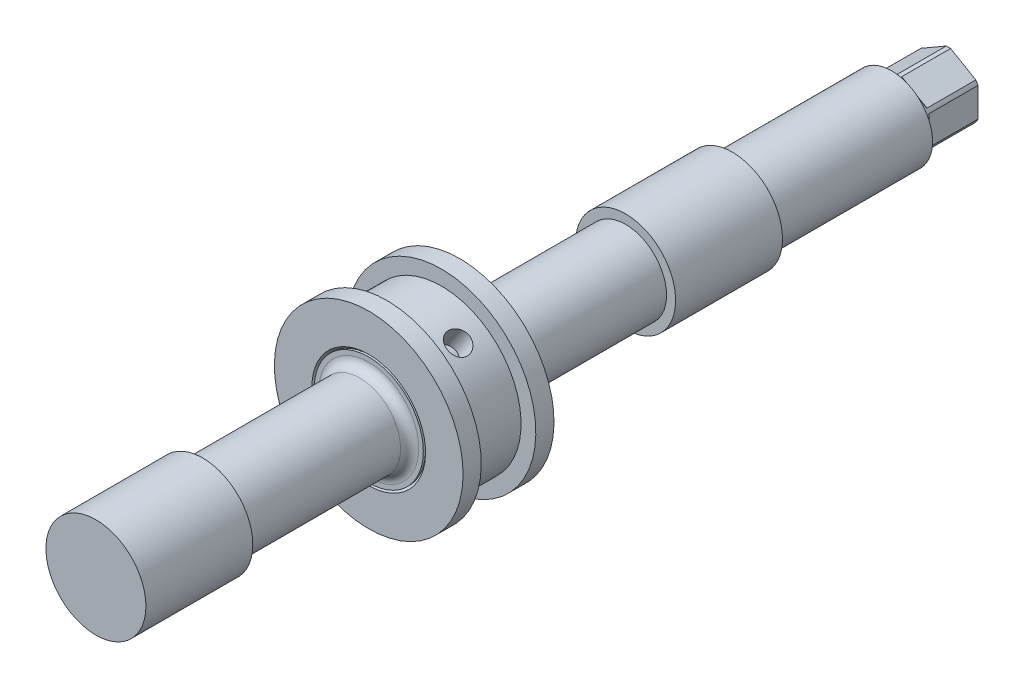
ISO-10303-21;
HEADER;
FILE_DESCRIPTION(('STEP AP214'),'2;1');
FILE_NAME('part.step','',(''),(''),'','','');
FILE_SCHEMA(('AUTOMOTIVE_DESIGN { 1 0 10303 214 1 1 1 1 }'));
ENDSEC;
DATA;
#1=APPLICATION_CONTEXT('core data for automotive mechanical design processes');
#2=APPLICATION_PROTOCOL_DEFINITION('international standard','automotive_design',2000,#1);
#3=PRODUCT_CONTEXT('',#1,'mechanical');
#4=PRODUCT('Part','Part','',(#3));
#5=PRODUCT_RELATED_PRODUCT_CATEGORY('part','',(#4));
#6=PRODUCT_DEFINITION_FORMATION('','',#4);
#7=PRODUCT_DEFINITION_CONTEXT('part definition',#1,'design');
#8=PRODUCT_DEFINITION('design','',#6,#7);
#9=PRODUCT_DEFINITION_SHAPE('','',#8);
#10=(LENGTH_UNIT() NAMED_UNIT(*) SI_UNIT(.MILLI.,.METRE.));
#11=(NAMED_UNIT(*) PLANE_ANGLE_UNIT() SI_UNIT($,.RADIAN.));
#12=(NAMED_UNIT(*) SI_UNIT($,.STERADIAN.) SOLID_ANGLE_UNIT());
#13=UNCERTAINTY_MEASURE_WITH_UNIT(LENGTH_MEASURE(1.E-05),#10,'distance_accuracy_value','');
#14=(GEOMETRIC_REPRESENTATION_CONTEXT(3) GLOBAL_UNCERTAINTY_ASSIGNED_CONTEXT((#13)) GLOBAL_UNIT_ASSIGNED_CONTEXT((#10,
#11,#12)) REPRESENTATION_CONTEXT('',''));
#15=CARTESIAN_POINT('',(0.,0.,0.));
#16=DIRECTION('',(0.,0.,1.));
#17=DIRECTION('',(1.,0.,0.));
#18=AXIS2_PLACEMENT_3D('',#15,#16,#17);
#19=CARTESIAN_POINT('',(0.,-7.50555349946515,-105.25));
#20=DIRECTION('',(-0.5,-0.866025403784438,0.));
#21=DIRECTION('',(0.866025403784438,-0.5,0.));
#22=AXIS2_PLACEMENT_3D('',#19,#20,#21);
#23=PLANE('',#22);
#24=DIRECTION('',(-0.866025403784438,0.5,0.));
#25=VECTOR('',#24,1.);
#26=CARTESIAN_POINT('',(-3.25,-5.62916512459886,-117.5));
#27=LINE('',#26,#25);
#28=CARTESIAN_POINT('',(-0.468925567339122,-7.234819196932,-117.5));
#29=VERTEX_POINT('',#28);
#30=CARTESIAN_POINT('',(-6.03107443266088,-4.0235110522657,-117.5));
#31=VERTEX_POINT('',#30);
#32=EDGE_CURVE('E11',#29,#31,#27,.T.);
#33=ORIENTED_EDGE('',*,*,#32,.F.);
#34=DIRECTION('',(0.,0.,-1.));
#35=VECTOR('',#34,1.);
#36=CARTESIAN_POINT('',(-0.468925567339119,-7.23481919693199,-105.));
#37=LINE('',#36,#35);
#38=CARTESIAN_POINT('',(-0.468925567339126,-7.23481919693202,-106.75));
#39=VERTEX_POINT('',#38);
#40=EDGE_CURVE('E245',#39,#29,#37,.T.);
#41=ORIENTED_EDGE('',*,*,#40,.F.);
#42=DIRECTION('',(0.866025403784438,-0.5,0.));
#43=VECTOR('',#42,1.);
#44=CARTESIAN_POINT('',(0.,-7.50555349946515,-106.75));
#45=LINE('',#44,#43);
#46=CARTESIAN_POINT('',(-6.03107443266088,-4.02351105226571,-106.75));
#47=VERTEX_POINT('',#46);
#48=EDGE_CURVE('E282',#39,#47,#45,.F.);
#49=ORIENTED_EDGE('',*,*,#48,.T.);
#50=DIRECTION('',(0.,0.,-1.));
#51=VECTOR('',#50,1.);
#52=CARTESIAN_POINT('',(-6.03107443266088,-4.02351105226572,-105.));
#53=LINE('',#52,#51);
#54=EDGE_CURVE('E255',#31,#47,#53,.F.);
#55=ORIENTED_EDGE('',*,*,#54,.F.);
#56=EDGE_LOOP('',(#33,#41,#49,#55));
#57=FACE_BOUND('',#56,.T.);
#58=ADVANCED_FACE('F18',(#57),#23,.T.);
#59=CARTESIAN_POINT('',(0.,0.,-117.5));
#60=DIRECTION('',(0.,0.,-1.));
#61=DIRECTION('',(-1.,0.,0.));
#62=AXIS2_PLACEMENT_3D('',#59,#60,#61);
#63=PLANE('',#62);
#64=CARTESIAN_POINT('',(0.,0.,-117.5));
#65=DIRECTION('',(0.,0.,-1.));
#66=DIRECTION('',(-1.,0.,0.));
#67=AXIS2_PLACEMENT_3D('',#64,#65,#66);
#68=CIRCLE('',#67,7.25);
#69=CARTESIAN_POINT('',(0.468925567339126,-7.23481919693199,-117.5));
#70=VERTEX_POINT('',#69);
#71=EDGE_CURVE('E220',#70,#29,#68,.T.);
#72=ORIENTED_EDGE('',*,*,#71,.T.);
#73=ORIENTED_EDGE('',*,*,#32,.T.);
#74=CARTESIAN_POINT('',(-6.5,-3.2113081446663,-117.5));
#75=VERTEX_POINT('',#74);
#76=EDGE_CURVE('E218',#31,#75,#68,.T.);
#77=ORIENTED_EDGE('',*,*,#76,.T.);
#78=DIRECTION('',(0.,1.,0.));
#79=VECTOR('',#78,1.);
#80=CARTESIAN_POINT('',(-6.5,0.,-117.5));
#81=LINE('',#80,#79);
#82=CARTESIAN_POINT('',(-6.5,3.21130814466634,-117.5));
#83=VERTEX_POINT('',#82);
#84=EDGE_CURVE('E215',#75,#83,#81,.T.);
#85=ORIENTED_EDGE('',*,*,#84,.T.);
#86=CARTESIAN_POINT('',(-6.03107443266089,4.02351105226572,-117.5));
#87=VERTEX_POINT('',#86);
#88=EDGE_CURVE('E221',#83,#87,#68,.T.);
#89=ORIENTED_EDGE('',*,*,#88,.T.);
#90=DIRECTION('',(0.866025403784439,0.5,0.));
#91=VECTOR('',#90,1.);
#92=CARTESIAN_POINT('',(-3.25,5.62916512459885,-117.5));
#93=LINE('',#92,#91);
#94=CARTESIAN_POINT('',(-0.468925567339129,7.23481919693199,-117.5));
#95=VERTEX_POINT('',#94);
#96=EDGE_CURVE('E34',#87,#95,#93,.T.);
#97=ORIENTED_EDGE('',*,*,#96,.T.);
#98=CARTESIAN_POINT('',(0.468925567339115,7.23481919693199,-117.5));
#99=VERTEX_POINT('',#98);
#100=EDGE_CURVE('E41',#95,#99,#68,.T.);
#101=ORIENTED_EDGE('',*,*,#100,.T.);
#102=DIRECTION('',(0.866025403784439,-0.5,0.));
#103=VECTOR('',#102,1.);
#104=CARTESIAN_POINT('',(3.25,5.62916512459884,-117.5));
#105=LINE('',#104,#103);
#106=CARTESIAN_POINT('',(6.03107443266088,4.02351105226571,-117.5));
#107=VERTEX_POINT('',#106);
#108=EDGE_CURVE('E223',#99,#107,#105,.T.);
#109=ORIENTED_EDGE('',*,*,#108,.T.);
#110=CARTESIAN_POINT('',(6.5,3.21130814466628,-117.5));
#111=VERTEX_POINT('',#110);
#112=EDGE_CURVE('E440',#107,#111,#68,.T.);
#113=ORIENTED_EDGE('',*,*,#112,.T.);
#114=DIRECTION('',(0.,-1.,0.));
#115=VECTOR('',#114,1.);
#116=CARTESIAN_POINT('',(6.5,0.,-117.5));
#117=LINE('',#116,#115);
#118=CARTESIAN_POINT('',(6.5,-3.2113081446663,-117.5));
#119=VERTEX_POINT('',#118);
#120=EDGE_CURVE('E225',#111,#119,#117,.T.);
#121=ORIENTED_EDGE('',*,*,#120,.T.);
#122=CARTESIAN_POINT('',(6.03107443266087,-4.02351105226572,-117.5));
#123=VERTEX_POINT('',#122);
#124=EDGE_CURVE('E233',#119,#123,#68,.T.);
#125=ORIENTED_EDGE('',*,*,#124,.T.);
#126=DIRECTION('',(-0.866025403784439,-0.5,0.));
#127=VECTOR('',#126,1.);
#128=CARTESIAN_POINT('',(3.25,-5.62916512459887,-117.5));
#129=LINE('',#128,#127);
#130=EDGE_CURVE('E27',#123,#70,#129,.T.);
#131=ORIENTED_EDGE('',*,*,#130,.T.);
#132=EDGE_LOOP('',(#72,#73,#77,#85,#89,#97,#101,#109,#113,#121,#125,#131));
#133=FACE_BOUND('',#132,.T.);
#134=ADVANCED_FACE('F231',(#133),#63,.T.);
#135=CARTESIAN_POINT('',(6.5,-3.7527767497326,-105.25));
#136=DIRECTION('',(0.5,-0.866025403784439,0.));
#137=DIRECTION('',(0.866025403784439,0.5,0.));
#138=AXIS2_PLACEMENT_3D('',#135,#136,#137);
#139=PLANE('',#138);
#140=ORIENTED_EDGE('',*,*,#130,.F.);
#141=DIRECTION('',(0.,0.,-1.));
#142=VECTOR('',#141,1.);
#143=CARTESIAN_POINT('',(6.03107443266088,-4.02351105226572,-105.));
#144=LINE('',#143,#142);
#145=CARTESIAN_POINT('',(6.03107443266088,-4.02351105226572,-106.75));
#146=VERTEX_POINT('',#145);
#147=EDGE_CURVE('E247',#146,#123,#144,.T.);
#148=ORIENTED_EDGE('',*,*,#147,.F.);
#149=DIRECTION('',(0.866025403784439,0.5,0.));
#150=VECTOR('',#149,1.);
#151=CARTESIAN_POINT('',(6.5,-3.75277674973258,-106.75));
#152=LINE('',#151,#150);
#153=CARTESIAN_POINT('',(0.468925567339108,-7.234819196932,-106.75));
#154=VERTEX_POINT('',#153);
#155=EDGE_CURVE('E240',#146,#154,#152,.F.);
#156=ORIENTED_EDGE('',*,*,#155,.T.);
#157=DIRECTION('',(0.,0.,-1.));
#158=VECTOR('',#157,1.);
#159=CARTESIAN_POINT('',(0.468925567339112,-7.23481919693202,-105.));
#160=LINE('',#159,#158);
#161=EDGE_CURVE('E238',#70,#154,#160,.F.);
#162=ORIENTED_EDGE('',*,*,#161,.F.);
#163=EDGE_LOOP('',(#140,#148,#156,#162));
#164=FACE_BOUND('',#163,.T.);
#165=ADVANCED_FACE('F239',(#164),#139,.T.);
#166=CARTESIAN_POINT('',(6.5,3.75277674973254,-105.25));
#167=DIRECTION('',(1.,0.,0.));
#168=DIRECTION('',(0.,0.,-1.));
#169=AXIS2_PLACEMENT_3D('',#166,#167,#168);
#170=PLANE('',#169);
#171=ORIENTED_EDGE('',*,*,#120,.F.);
#172=DIRECTION('',(0.,0.,-1.));
#173=VECTOR('',#172,1.);
#174=CARTESIAN_POINT('',(6.5,3.21130814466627,-105.));
#175=LINE('',#174,#173);
#176=CARTESIAN_POINT('',(6.5,3.21130814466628,-106.75));
#177=VERTEX_POINT('',#176);
#178=EDGE_CURVE('E275',#177,#111,#175,.T.);
#179=ORIENTED_EDGE('',*,*,#178,.F.);
#180=DIRECTION('',(0.,1.,0.));
#181=VECTOR('',#180,1.);
#182=CARTESIAN_POINT('',(6.5,3.75277674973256,-106.75));
#183=LINE('',#182,#181);
#184=CARTESIAN_POINT('',(6.5,-3.2113081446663,-106.75));
#185=VERTEX_POINT('',#184);
#186=EDGE_CURVE('E278',#185,#177,#183,.T.);
#187=ORIENTED_EDGE('',*,*,#186,.F.);
#188=DIRECTION('',(0.,0.,-1.));
#189=VECTOR('',#188,1.);
#190=CARTESIAN_POINT('',(6.5,-3.21130814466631,-105.));
#191=LINE('',#190,#189);
#192=EDGE_CURVE('E340',#119,#185,#191,.F.);
#193=ORIENTED_EDGE('',*,*,#192,.F.);
#194=EDGE_LOOP('',(#171,#179,#187,#193));
#195=FACE_BOUND('',#194,.T.);
#196=ADVANCED_FACE('F446',(#195),#170,.T.);
#197=CARTESIAN_POINT('',(0.,7.50555349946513,-105.25));
#198=DIRECTION('',(0.5,0.866025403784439,0.));
#199=DIRECTION('',(-0.866025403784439,0.5,0.));
#200=AXIS2_PLACEMENT_3D('',#197,#198,#199);
#201=PLANE('',#200);
#202=ORIENTED_EDGE('',*,*,#108,.F.);
#203=DIRECTION('',(0.,0.,-1.));
#204=VECTOR('',#203,1.);
#205=CARTESIAN_POINT('',(0.468925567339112,7.23481919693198,-105.));
#206=LINE('',#205,#204);
#207=CARTESIAN_POINT('',(0.468925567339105,7.23481919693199,-106.75));
#208=VERTEX_POINT('',#207);
#209=EDGE_CURVE('E269',#208,#99,#206,.T.);
#210=ORIENTED_EDGE('',*,*,#209,.F.);
#211=DIRECTION('',(-0.866025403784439,0.5,0.));
#212=VECTOR('',#211,1.);
#213=CARTESIAN_POINT('',(0.,7.50555349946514,-106.75));
#214=LINE('',#213,#212);
#215=CARTESIAN_POINT('',(6.03107443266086,4.02351105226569,-106.75));
#216=VERTEX_POINT('',#215);
#217=EDGE_CURVE('E134',#208,#216,#214,.F.);
#218=ORIENTED_EDGE('',*,*,#217,.T.);
#219=DIRECTION('',(0.,0.,-1.));
#220=VECTOR('',#219,1.);
#221=CARTESIAN_POINT('',(6.03107443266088,4.02351105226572,-105.));
#222=LINE('',#221,#220);
#223=EDGE_CURVE('E273',#107,#216,#222,.F.);
#224=ORIENTED_EDGE('',*,*,#223,.F.);
#225=EDGE_LOOP('',(#202,#210,#218,#224));
#226=FACE_BOUND('',#225,.T.);
#227=ADVANCED_FACE('F448',(#226),#201,.T.);
#228=CARTESIAN_POINT('',(-6.5,3.75277674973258,-105.25));
#229=DIRECTION('',(-0.5,0.866025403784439,0.));
#230=DIRECTION('',(-0.866025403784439,-0.5,0.));
#231=AXIS2_PLACEMENT_3D('',#228,#229,#230);
#232=PLANE('',#231);
#233=ORIENTED_EDGE('',*,*,#96,.F.);
#234=DIRECTION('',(0.,0.,-1.));
#235=VECTOR('',#234,1.);
#236=CARTESIAN_POINT('',(-6.03107443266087,4.02351105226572,-105.));
#237=LINE('',#236,#235);
#238=CARTESIAN_POINT('',(-6.03107443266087,4.02351105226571,-106.75));
#239=VERTEX_POINT('',#238);
#240=EDGE_CURVE('E263',#239,#87,#237,.T.);
#241=ORIENTED_EDGE('',*,*,#240,.F.);
#242=DIRECTION('',(-0.866025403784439,-0.5,0.));
#243=VECTOR('',#242,1.);
#244=CARTESIAN_POINT('',(-6.5,3.75277674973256,-106.75));
#245=LINE('',#244,#243);
#246=CARTESIAN_POINT('',(-0.468925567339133,7.23481919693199,-106.75));
#247=VERTEX_POINT('',#246);
#248=EDGE_CURVE('E288',#239,#247,#245,.F.);
#249=ORIENTED_EDGE('',*,*,#248,.T.);
#250=DIRECTION('',(0.,0.,-1.));
#251=VECTOR('',#250,1.);
#252=CARTESIAN_POINT('',(-0.46892556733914,7.234819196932,-105.));
#253=LINE('',#252,#251);
#254=EDGE_CURVE('E267',#95,#247,#253,.F.);
#255=ORIENTED_EDGE('',*,*,#254,.F.);
#256=EDGE_LOOP('',(#233,#241,#249,#255));
#257=FACE_BOUND('',#256,.T.);
#258=ADVANCED_FACE('F454',(#257),#232,.T.);
#259=CARTESIAN_POINT('',(0.,0.,-105.));
#260=DIRECTION('',(0.,0.,-1.));
#261=DIRECTION('',(-1.,0.,0.));
#262=AXIS2_PLACEMENT_3D('',#259,#260,#261);
#263=CYLINDRICAL_SURFACE('',#262,7.25);
#264=CARTESIAN_POINT('',(0.,0.,-105.));
#265=DIRECTION('',(0.,0.,-1.));
#266=DIRECTION('',(-1.,0.,0.));
#267=AXIS2_PLACEMENT_3D('',#264,#265,#266);
#268=CIRCLE('',#267,7.25);
#269=CARTESIAN_POINT('',(-7.25,0.,-105.));
#270=VERTEX_POINT('',#269);
#271=EDGE_CURVE('E336',#270,#270,#268,.F.);
#272=ORIENTED_EDGE('',*,*,#271,.F.);
#273=EDGE_LOOP('',(#272));
#274=FACE_BOUND('',#273,.T.);
#275=ORIENTED_EDGE('',*,*,#88,.F.);
#276=DIRECTION('',(0.,0.,-1.));
#277=VECTOR('',#276,1.);
#278=CARTESIAN_POINT('',(-6.49999999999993,3.21130814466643,-105.));
#279=LINE('',#278,#277);
#280=CARTESIAN_POINT('',(-6.5,3.21130814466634,-106.75));
#281=VERTEX_POINT('',#280);
#282=EDGE_CURVE('E261',#83,#281,#279,.F.);
#283=ORIENTED_EDGE('',*,*,#282,.T.);
#284=CARTESIAN_POINT('',(0.,0.,-113.25));
#285=DIRECTION('',(-0.707106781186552,0.,-0.707106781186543));
#286=DIRECTION('',(0.707106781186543,0.,-0.707106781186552));
#287=AXIS2_PLACEMENT_3D('',#284,#285,#286);
#288=ELLIPSE('',#287,10.253048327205,7.25);
#289=CARTESIAN_POINT('',(-6.5,-3.21130814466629,-106.75));
#290=VERTEX_POINT('',#289);
#291=EDGE_CURVE('E260',#281,#290,#288,.F.);
#292=ORIENTED_EDGE('',*,*,#291,.T.);
#293=DIRECTION('',(0.,0.,-1.));
#294=VECTOR('',#293,1.);
#295=CARTESIAN_POINT('',(-6.5,-3.21130814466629,-105.));
#296=LINE('',#295,#294);
#297=EDGE_CURVE('E257',#290,#75,#296,.T.);
#298=ORIENTED_EDGE('',*,*,#297,.T.);
#299=ORIENTED_EDGE('',*,*,#76,.F.);
#300=ORIENTED_EDGE('',*,*,#54,.T.);
#301=CARTESIAN_POINT('',(0.,0.,-113.25));
#302=DIRECTION('',(-0.353553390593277,-0.612372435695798,-0.707106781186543));
#303=DIRECTION('',(0.353553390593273,0.61237243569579,-0.707106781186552));
#304=AXIS2_PLACEMENT_3D('',#301,#302,#303);
#305=ELLIPSE('',#304,10.253048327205,7.25);
#306=EDGE_CURVE('E250',#47,#39,#305,.F.);
#307=ORIENTED_EDGE('',*,*,#306,.T.);
#308=ORIENTED_EDGE('',*,*,#40,.T.);
#309=ORIENTED_EDGE('',*,*,#71,.F.);
#310=ORIENTED_EDGE('',*,*,#161,.T.);
#311=CARTESIAN_POINT('',(0.,0.,-113.25));
#312=DIRECTION('',(0.353553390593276,-0.612372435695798,-0.707106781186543));
#313=DIRECTION('',(-0.353553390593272,0.612372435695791,-0.707106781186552));
#314=AXIS2_PLACEMENT_3D('',#311,#312,#313);
#315=ELLIPSE('',#314,10.253048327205,7.25);
#316=EDGE_CURVE('E244',#154,#146,#315,.F.);
#317=ORIENTED_EDGE('',*,*,#316,.T.);
#318=ORIENTED_EDGE('',*,*,#147,.T.);
#319=ORIENTED_EDGE('',*,*,#124,.F.);
#320=ORIENTED_EDGE('',*,*,#192,.T.);
#321=CARTESIAN_POINT('',(0.,0.,-113.25));
#322=DIRECTION('',(0.707106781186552,0.,-0.707106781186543));
#323=DIRECTION('',(-0.707106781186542,0.,-0.707106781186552));
#324=AXIS2_PLACEMENT_3D('',#321,#322,#323);
#325=ELLIPSE('',#324,10.253048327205,7.25);
#326=EDGE_CURVE('E339',#185,#177,#325,.F.);
#327=ORIENTED_EDGE('',*,*,#326,.T.);
#328=ORIENTED_EDGE('',*,*,#178,.T.);
#329=ORIENTED_EDGE('',*,*,#112,.F.);
#330=ORIENTED_EDGE('',*,*,#223,.T.);
#331=CARTESIAN_POINT('',(0.,0.,-113.25));
#332=DIRECTION('',(0.353553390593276,0.612372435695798,-0.707106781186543));
#333=DIRECTION('',(-0.353553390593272,-0.612372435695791,-0.707106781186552));
#334=AXIS2_PLACEMENT_3D('',#331,#332,#333);
#335=ELLIPSE('',#334,10.253048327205,7.25);
#336=EDGE_CURVE('E272',#216,#208,#335,.F.);
#337=ORIENTED_EDGE('',*,*,#336,.T.);
#338=ORIENTED_EDGE('',*,*,#209,.T.);
#339=ORIENTED_EDGE('',*,*,#100,.F.);
#340=ORIENTED_EDGE('',*,*,#254,.T.);
#341=CARTESIAN_POINT('',(0.,0.,-113.25));
#342=DIRECTION('',(-0.353553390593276,0.612372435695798,-0.707106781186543));
#343=DIRECTION('',(0.353553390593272,-0.612372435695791,-0.707106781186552));
#344=AXIS2_PLACEMENT_3D('',#341,#342,#343);
#345=ELLIPSE('',#344,10.253048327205,7.25);
#346=EDGE_CURVE('E266',#247,#239,#345,.F.);
#347=ORIENTED_EDGE('',*,*,#346,.T.);
#348=ORIENTED_EDGE('',*,*,#240,.T.);
#349=EDGE_LOOP('',(#275,#283,#292,#298,#299,#300,#307,#308,#309,#310,#317,#318,#319,#320,#327,
#328,#329,#330,#337,#338,#339,#340,#347,#348));
#350=FACE_BOUND('',#349,.T.);
#351=ADVANCED_FACE('F20',(#274,#350),#263,.T.);
#352=CARTESIAN_POINT('',(0.,0.,-70.));
#353=DIRECTION('',(0.,0.,-1.));
#354=DIRECTION('',(-1.,0.,0.));
#355=AXIS2_PLACEMENT_3D('',#352,#353,#354);
#356=CYLINDRICAL_SURFACE('',#355,9.);
#357=CARTESIAN_POINT('',(0.,0.,-70.));
#358=DIRECTION('',(0.,0.,-1.));
#359=DIRECTION('',(-1.,0.,0.));
#360=AXIS2_PLACEMENT_3D('',#357,#358,#359);
#361=CIRCLE('',#360,9.);
#362=CARTESIAN_POINT('',(-9.,0.,-70.));
#363=VERTEX_POINT('',#362);
#364=EDGE_CURVE('E326',#363,#363,#361,.F.);
#365=ORIENTED_EDGE('',*,*,#364,.F.);
#366=EDGE_LOOP('',(#365));
#367=FACE_BOUND('',#366,.T.);
#368=CARTESIAN_POINT('',(0.,0.,-105.));
#369=DIRECTION('',(0.,0.,-1.));
#370=DIRECTION('',(-1.,0.,0.));
#371=AXIS2_PLACEMENT_3D('',#368,#369,#370);
#372=CIRCLE('',#371,9.);
#373=CARTESIAN_POINT('',(-9.,0.,-105.));
#374=VERTEX_POINT('',#373);
#375=EDGE_CURVE('E209',#374,#374,#372,.F.);
#376=ORIENTED_EDGE('',*,*,#375,.T.);
#377=EDGE_LOOP('',(#376));
#378=FACE_BOUND('',#377,.T.);
#379=ADVANCED_FACE('F472',(#367,#378),#356,.T.);
#380=CARTESIAN_POINT('',(0.,0.,-70.));
#381=DIRECTION('',(0.,0.,-1.));
#382=DIRECTION('',(-1.,0.,0.));
#383=AXIS2_PLACEMENT_3D('',#380,#381,#382);
#384=PLANE('',#383);
#385=ORIENTED_EDGE('',*,*,#364,.T.);
#386=EDGE_LOOP('',(#385));
#387=FACE_BOUND('',#386,.T.);
#388=CARTESIAN_POINT('',(0.,0.,-70.));
#389=DIRECTION('',(0.,0.,-1.));
#390=DIRECTION('',(-1.,0.,0.));
#391=AXIS2_PLACEMENT_3D('',#388,#389,#390);
#392=CIRCLE('',#391,11.);
#393=CARTESIAN_POINT('',(-11.,0.,-70.));
#394=VERTEX_POINT('',#393);
#395=EDGE_CURVE('E206',#394,#394,#392,.T.);
#396=ORIENTED_EDGE('',*,*,#395,.T.);
#397=EDGE_LOOP('',(#396));
#398=FACE_BOUND('',#397,.T.);
#399=ADVANCED_FACE('F475',(#387,#398),#384,.T.);
#400=CARTESIAN_POINT('',(0.,0.,-46.5));
#401=DIRECTION('',(0.,0.,1.));
#402=DIRECTION('',(1.,0.,0.));
#403=AXIS2_PLACEMENT_3D('',#400,#401,#402);
#404=CYLINDRICAL_SURFACE('',#403,9.);
#405=CARTESIAN_POINT('',(0.,0.,-12.));
#406=DIRECTION('',(0.,0.,1.));
#407=DIRECTION('',(1.,0.,0.));
#408=AXIS2_PLACEMENT_3D('',#405,#406,#407);
#409=CIRCLE('',#408,9.);
#410=CARTESIAN_POINT('',(8.99999999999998,0.,-12.));
#411=VERTEX_POINT('',#410);
#412=EDGE_CURVE('E197',#411,#411,#409,.F.);
#413=ORIENTED_EDGE('',*,*,#412,.T.);
#414=EDGE_LOOP('',(#413));
#415=FACE_BOUND('',#414,.T.);
#416=CARTESIAN_POINT('',(0.,0.,-46.5));
#417=DIRECTION('',(0.,0.,1.));
#418=DIRECTION('',(1.,0.,0.));
#419=AXIS2_PLACEMENT_3D('',#416,#417,#418);
#420=CIRCLE('',#419,9.);
#421=CARTESIAN_POINT('',(9.,0.,-46.5));
#422=VERTEX_POINT('',#421);
#423=EDGE_CURVE('E322',#422,#422,#420,.T.);
#424=ORIENTED_EDGE('',*,*,#423,.T.);
#425=EDGE_LOOP('',(#424));
#426=FACE_BOUND('',#425,.T.);
#427=ADVANCED_FACE('F369',(#415,#426),#404,.T.);
#428=CARTESIAN_POINT('',(0.,0.,-46.5));
#429=DIRECTION('',(0.,0.,-1.));
#430=DIRECTION('',(-1.,0.,0.));
#431=AXIS2_PLACEMENT_3D('',#428,#429,#430);
#432=PLANE('',#431);
#433=CARTESIAN_POINT('',(0.,0.,-46.5));
#434=DIRECTION('',(0.,0.,-1.));
#435=DIRECTION('',(-1.,0.,0.));
#436=AXIS2_PLACEMENT_3D('',#433,#434,#435);
#437=CIRCLE('',#436,11.);
#438=CARTESIAN_POINT('',(-11.,0.,-46.5));
#439=VERTEX_POINT('',#438);
#440=EDGE_CURVE('E203',#439,#439,#437,.T.);
#441=ORIENTED_EDGE('',*,*,#440,.F.);
#442=EDGE_LOOP('',(#441));
#443=FACE_BOUND('',#442,.T.);
#444=ORIENTED_EDGE('',*,*,#423,.F.);
#445=EDGE_LOOP('',(#444));
#446=FACE_BOUND('',#445,.T.);
#447=ADVANCED_FACE('F368',(#443,#446),#432,.F.);
#448=CARTESIAN_POINT('',(0.,0.,-12.));
#449=DIRECTION('',(0.,0.,1.));
#450=DIRECTION('',(1.,0.,0.));
#451=AXIS2_PLACEMENT_3D('',#448,#449,#450);
#452=TOROIDAL_SURFACE('',#451,11.,2.);
#453=CARTESIAN_POINT('',(0.,0.,-10.));
#454=DIRECTION('',(0.,0.,-1.));
#455=DIRECTION('',(-1.,0.,0.));
#456=AXIS2_PLACEMENT_3D('',#453,#454,#455);
#457=CIRCLE('',#456,11.);
#458=CARTESIAN_POINT('',(11.,0.,-10.));
#459=VERTEX_POINT('',#458);
#460=CARTESIAN_POINT('',(-11.,0.,-10.));
#461=VERTEX_POINT('',#460);
#462=EDGE_CURVE('E325',#459,#461,#457,.F.);
#463=ORIENTED_EDGE('',*,*,#462,.F.);
#464=CARTESIAN_POINT('',(0.,0.,-10.));
#465=DIRECTION('',(0.,0.,-1.));
#466=DIRECTION('',(1.,0.,0.));
#467=AXIS2_PLACEMENT_3D('',#464,#465,#466);
#468=CIRCLE('',#467,11.);
#469=EDGE_CURVE('E329',#461,#459,#468,.F.);
#470=ORIENTED_EDGE('',*,*,#469,.F.);
#471=EDGE_LOOP('',(#463,#470));
#472=FACE_BOUND('',#471,.T.);
#473=ORIENTED_EDGE('',*,*,#412,.F.);
#474=EDGE_LOOP('',(#473));
#475=FACE_BOUND('',#474,.T.);
#476=ADVANCED_FACE('F176',(#472,#475),#452,.F.);
#477=CARTESIAN_POINT('',(0.,0.,-10.));
#478=DIRECTION('',(0.,0.,1.));
#479=DIRECTION('',(1.,0.,0.));
#480=AXIS2_PLACEMENT_3D('',#477,#478,#479);
#481=PLANE('',#480);
#482=ORIENTED_EDGE('',*,*,#469,.T.);
#483=ORIENTED_EDGE('',*,*,#462,.T.);
#484=EDGE_LOOP('',(#482,#483));
#485=FACE_BOUND('',#484,.T.);
#486=CARTESIAN_POINT('',(0.,0.,-10.));
#487=DIRECTION('',(0.,0.,-1.));
#488=DIRECTION('',(-0.443238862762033,0.896403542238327,0.));
#489=AXIS2_PLACEMENT_3D('',#486,#487,#488);
#490=CIRCLE('',#489,20.75);
#491=CARTESIAN_POINT('',(-9.1972064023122,18.6003735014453,-10.));
#492=VERTEX_POINT('',#491);
#493=EDGE_CURVE('E877',#492,#492,#490,.F.);
#494=ORIENTED_EDGE('',*,*,#493,.F.);
#495=EDGE_LOOP('',(#494));
#496=FACE_BOUND('',#495,.T.);
#497=ADVANCED_FACE('F171',(#485,#496),#481,.F.);
#498=CARTESIAN_POINT('',(0.,0.,147.));
#499=DIRECTION('',(0.,0.,-1.));
#500=DIRECTION('',(-1.,0.,0.));
#501=AXIS2_PLACEMENT_3D('',#498,#499,#500);
#502=CYLINDRICAL_SURFACE('',#501,11.);
#503=ORIENTED_EDGE('',*,*,#395,.F.);
#504=EDGE_LOOP('',(#503));
#505=FACE_BOUND('',#504,.T.);
#506=ORIENTED_EDGE('',*,*,#440,.T.);
#507=EDGE_LOOP('',(#506));
#508=FACE_BOUND('',#507,.T.);
#509=ADVANCED_FACE('F175',(#505,#508),#502,.T.);
#510=CARTESIAN_POINT('',(0.,7.50555349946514,-106.75));
#511=DIRECTION('',(0.353553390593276,0.612372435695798,-0.707106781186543));
#512=DIRECTION('',(0.,0.755928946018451,0.654653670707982));
#513=AXIS2_PLACEMENT_3D('',#510,#511,#512);
#514=PLANE('',#513);
#515=ORIENTED_EDGE('',*,*,#217,.F.);
#516=ORIENTED_EDGE('',*,*,#336,.F.);
#517=EDGE_LOOP('',(#515,#516));
#518=FACE_BOUND('',#517,.T.);
#519=ADVANCED_FACE('F301',(#518),#514,.T.);
#520=CARTESIAN_POINT('',(-6.5,3.75277674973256,-106.75));
#521=DIRECTION('',(-0.353553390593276,0.612372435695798,-0.707106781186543));
#522=DIRECTION('',(0.,0.75592894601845,0.654653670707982));
#523=AXIS2_PLACEMENT_3D('',#520,#521,#522);
#524=PLANE('',#523);
#525=ORIENTED_EDGE('',*,*,#248,.F.);
#526=ORIENTED_EDGE('',*,*,#346,.F.);
#527=EDGE_LOOP('',(#525,#526));
#528=FACE_BOUND('',#527,.T.);
#529=ADVANCED_FACE('F431',(#528),#524,.T.);
#530=CARTESIAN_POINT('',(-6.5,-3.7527767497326,-106.75));
#531=DIRECTION('',(-0.707106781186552,0.,-0.707106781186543));
#532=DIRECTION('',(-0.707106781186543,0.,0.707106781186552));
#533=AXIS2_PLACEMENT_3D('',#530,#531,#532);
#534=PLANE('',#533);
#535=ORIENTED_EDGE('',*,*,#291,.F.);
#536=DIRECTION('',(0.,-1.,0.));
#537=VECTOR('',#536,1.);
#538=CARTESIAN_POINT('',(-6.5,-3.7527767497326,-106.75));
#539=LINE('',#538,#537);
#540=EDGE_CURVE('E285',#290,#281,#539,.F.);
#541=ORIENTED_EDGE('',*,*,#540,.F.);
#542=EDGE_LOOP('',(#535,#541));
#543=FACE_BOUND('',#542,.T.);
#544=ADVANCED_FACE('F425',(#543),#534,.T.);
#545=CARTESIAN_POINT('',(-6.5,-3.75277674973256,-105.25));
#546=DIRECTION('',(-1.,0.,0.));
#547=DIRECTION('',(0.,-1.,0.));
#548=AXIS2_PLACEMENT_3D('',#545,#546,#547);
#549=PLANE('',#548);
#550=ORIENTED_EDGE('',*,*,#84,.F.);
#551=ORIENTED_EDGE('',*,*,#297,.F.);
#552=ORIENTED_EDGE('',*,*,#540,.T.);
#553=ORIENTED_EDGE('',*,*,#282,.F.);
#554=EDGE_LOOP('',(#550,#551,#552,#553));
#555=FACE_BOUND('',#554,.T.);
#556=ADVANCED_FACE('F411',(#555),#549,.T.);
#557=CARTESIAN_POINT('',(0.,-7.50555349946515,-106.75));
#558=DIRECTION('',(-0.353553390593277,-0.612372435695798,-0.707106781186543));
#559=DIRECTION('',(0.,0.75592894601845,-0.654653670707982));
#560=AXIS2_PLACEMENT_3D('',#557,#558,#559);
#561=PLANE('',#560);
#562=ORIENTED_EDGE('',*,*,#48,.F.);
#563=ORIENTED_EDGE('',*,*,#306,.F.);
#564=EDGE_LOOP('',(#562,#563));
#565=FACE_BOUND('',#564,.T.);
#566=ADVANCED_FACE('F401',(#565),#561,.T.);
#567=CARTESIAN_POINT('',(6.5,-3.75277674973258,-106.75));
#568=DIRECTION('',(0.353553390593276,-0.612372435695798,-0.707106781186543));
#569=DIRECTION('',(0.,0.75592894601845,-0.654653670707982));
#570=AXIS2_PLACEMENT_3D('',#567,#568,#569);
#571=PLANE('',#570);
#572=ORIENTED_EDGE('',*,*,#155,.F.);
#573=ORIENTED_EDGE('',*,*,#316,.F.);
#574=EDGE_LOOP('',(#572,#573));
#575=FACE_BOUND('',#574,.T.);
#576=ADVANCED_FACE('F398',(#575),#571,.T.);
#577=CARTESIAN_POINT('',(6.5,3.75277674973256,-106.75));
#578=DIRECTION('',(0.707106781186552,0.,-0.707106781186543));
#579=DIRECTION('',(-0.707106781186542,0.,-0.707106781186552));
#580=AXIS2_PLACEMENT_3D('',#577,#578,#579);
#581=PLANE('',#580);
#582=ORIENTED_EDGE('',*,*,#186,.T.);
#583=ORIENTED_EDGE('',*,*,#326,.F.);
#584=EDGE_LOOP('',(#582,#583));
#585=FACE_BOUND('',#584,.T.);
#586=ADVANCED_FACE('F400',(#585),#581,.T.);
#587=CARTESIAN_POINT('',(0.,0.,-105.));
#588=DIRECTION('',(0.,0.,-1.));
#589=DIRECTION('',(-1.,0.,0.));
#590=AXIS2_PLACEMENT_3D('',#587,#588,#589);
#591=PLANE('',#590);
#592=ORIENTED_EDGE('',*,*,#375,.F.);
#593=EDGE_LOOP('',(#592));
#594=FACE_BOUND('',#593,.T.);
#595=ORIENTED_EDGE('',*,*,#271,.T.);
#596=EDGE_LOOP('',(#595));
#597=FACE_BOUND('',#596,.T.);
#598=ADVANCED_FACE('F409',(#594,#597),#591,.T.);
#599=CARTESIAN_POINT('',(0.,0.,10.));
#600=DIRECTION('',(0.,0.,-1.));
#601=DIRECTION('',(-0.443238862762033,0.896403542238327,0.));
#602=AXIS2_PLACEMENT_3D('',#599,#600,#601);
#603=PLANE('',#602);
#604=CARTESIAN_POINT('',(0.,0.,10.));
#605=DIRECTION('',(0.,0.,-1.));
#606=DIRECTION('',(-0.443238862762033,0.896403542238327,0.));
#607=AXIS2_PLACEMENT_3D('',#604,#605,#606);
#608=CIRCLE('',#607,20.75);
#609=CARTESIAN_POINT('',(-9.19720640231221,18.6003735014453,9.99999999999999));
#610=VERTEX_POINT('',#609);
#611=EDGE_CURVE('E883',#610,#610,#608,.T.);
#612=ORIENTED_EDGE('',*,*,#611,.F.);
#613=EDGE_LOOP('',(#612));
#614=FACE_BOUND('',#613,.T.);
#615=CARTESIAN_POINT('',(0.,0.,10.));
#616=DIRECTION('',(0.,0.,1.));
#617=DIRECTION('',(0.896403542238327,0.443238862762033,0.));
#618=AXIS2_PLACEMENT_3D('',#615,#616,#617);
#619=CIRCLE('',#618,12.5);
#620=CARTESIAN_POINT('',(11.2050442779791,5.5404857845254,10.));
#621=VERTEX_POINT('',#620);
#622=EDGE_CURVE('E861',#621,#621,#619,.T.);
#623=ORIENTED_EDGE('',*,*,#622,.F.);
#624=EDGE_LOOP('',(#623));
#625=FACE_BOUND('',#624,.T.);
#626=ADVANCED_FACE('F470',(#614,#625),#603,.F.);
#627=CARTESIAN_POINT('',(0.,0.,10.));
#628=DIRECTION('',(0.,0.,1.));
#629=DIRECTION('',(0.896403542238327,0.443238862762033,0.));
#630=AXIS2_PLACEMENT_3D('',#627,#628,#629);
#631=CONICAL_SURFACE('',#630,12.5,0.785398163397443);
#632=CARTESIAN_POINT('',(0.,0.,9.5));
#633=DIRECTION('',(0.,0.,1.));
#634=DIRECTION('',(1.,0.,0.));
#635=AXIS2_PLACEMENT_3D('',#632,#633,#634);
#636=CIRCLE('',#635,12.);
#637=CARTESIAN_POINT('',(12.,0.,9.50000000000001));
#638=VERTEX_POINT('',#637);
#639=EDGE_CURVE('E22',#638,#638,#636,.T.);
#640=ORIENTED_EDGE('',*,*,#639,.F.);
#641=EDGE_LOOP('',(#640));
#642=FACE_BOUND('',#641,.T.);
#643=ORIENTED_EDGE('',*,*,#622,.T.);
#644=EDGE_LOOP('',(#643));
#645=FACE_BOUND('',#644,.T.);
#646=ADVANCED_FACE('F623',(#642,#645),#631,.F.);
#647=CARTESIAN_POINT('',(0.,0.,6.));
#648=DIRECTION('',(0.,0.,-1.));
#649=DIRECTION('',(-0.443238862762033,0.896403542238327,0.));
#650=AXIS2_PLACEMENT_3D('',#647,#648,#649);
#651=PLANE('',#650);
#652=CARTESIAN_POINT('',(0.,0.,6.));
#653=DIRECTION('',(0.,0.,-1.));
#654=DIRECTION('',(-0.443238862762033,0.896403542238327,0.));
#655=AXIS2_PLACEMENT_3D('',#652,#653,#654);
#656=CIRCLE('',#655,20.75);
#657=CARTESIAN_POINT('',(-9.19720640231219,18.6003735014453,6.));
#658=VERTEX_POINT('',#657);
#659=EDGE_CURVE('E865',#658,#658,#656,.F.);
#660=ORIENTED_EDGE('',*,*,#659,.F.);
#661=EDGE_LOOP('',(#660));
#662=FACE_BOUND('',#661,.T.);
#663=CARTESIAN_POINT('',(0.,0.,6.));
#664=DIRECTION('',(0.,0.,-1.));
#665=DIRECTION('',(-0.443238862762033,0.896403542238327,0.));
#666=AXIS2_PLACEMENT_3D('',#663,#664,#665);
#667=CIRCLE('',#666,17.5);
#668=CARTESIAN_POINT('',(-7.75668009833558,15.6870619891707,6.));
#669=VERTEX_POINT('',#668);
#670=EDGE_CURVE('E862',#669,#669,#667,.F.);
#671=ORIENTED_EDGE('',*,*,#670,.T.);
#672=EDGE_LOOP('',(#671));
#673=FACE_BOUND('',#672,.T.);
#674=ADVANCED_FACE('F632',(#662,#673),#651,.T.);
#675=CARTESIAN_POINT('',(0.,0.,6.));
#676=DIRECTION('',(0.,0.,-1.));
#677=DIRECTION('',(-0.443238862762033,0.896403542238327,0.));
#678=AXIS2_PLACEMENT_3D('',#675,#676,#677);
#679=CYLINDRICAL_SURFACE('',#678,17.5);
#680=CARTESIAN_POINT('',(7.75668009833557,-15.6870619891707,-2.5));
#681=CARTESIAN_POINT('',(7.88187391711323,-15.6251557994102,-2.49999418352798));
#682=CARTESIAN_POINT('',(8.00639515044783,-15.5617022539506,-2.4882569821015));
#683=CARTESIAN_POINT('',(8.25052517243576,-15.4336609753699,-2.44162715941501));
#684=CARTESIAN_POINT('',(8.37012894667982,-15.3690721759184,-2.40671149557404));
#685=CARTESIAN_POINT('',(8.60105621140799,-15.2410384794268,-2.31478484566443));
#686=CARTESIAN_POINT('',(8.71238568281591,-15.1775927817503,-2.25779000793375));
#687=CARTESIAN_POINT('',(8.92402209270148,-15.0541309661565,-2.12336114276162));
#688=CARTESIAN_POINT('',(9.02433066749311,-14.9941143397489,-2.04593015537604));
#689=CARTESIAN_POINT('',(9.21215009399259,-14.8794654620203,-1.87223957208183));
#690=CARTESIAN_POINT('',(9.29957552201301,-14.8248698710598,-1.77586339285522));
#691=CARTESIAN_POINT('',(9.45882776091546,-14.7237731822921,-1.56726896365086));
#692=CARTESIAN_POINT('',(9.53065370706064,-14.6772725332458,-1.45504983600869));
#693=CARTESIAN_POINT('',(9.65733671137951,-14.5942327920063,-1.21733720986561));
#694=CARTESIAN_POINT('',(9.71211686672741,-14.5577389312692,-1.09178688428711));
#695=CARTESIAN_POINT('',(9.80299073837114,-14.4967026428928,-0.831363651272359));
#696=CARTESIAN_POINT('',(9.83908537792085,-14.4721596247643,-0.696491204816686));
#697=CARTESIAN_POINT('',(9.89155413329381,-14.4363488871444,-0.422224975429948));
#698=CARTESIAN_POINT('',(9.90806075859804,-14.4249919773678,-0.282868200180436));
#699=CARTESIAN_POINT('',(9.92140349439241,-14.4158184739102,-0.00277773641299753));
#700=CARTESIAN_POINT('',(9.91824063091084,-14.4180011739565,0.137955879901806));
#701=CARTESIAN_POINT('',(9.8924208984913,-14.4357280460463,0.415691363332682));
#702=CARTESIAN_POINT('',(9.86991044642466,-14.4511718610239,0.552713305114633));
#703=CARTESIAN_POINT('',(9.80611907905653,-14.4945335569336,0.820257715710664));
#704=CARTESIAN_POINT('',(9.76483767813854,-14.522451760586,0.950780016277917));
#705=CARTESIAN_POINT('',(9.66427174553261,-14.5895682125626,1.20215818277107));
#706=CARTESIAN_POINT('',(9.60492330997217,-14.6288064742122,1.3229777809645));
#707=CARTESIAN_POINT('',(9.46962218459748,-14.716750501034,1.55112303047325));
#708=CARTESIAN_POINT('',(9.39366850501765,-14.7654568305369,1.65844787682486));
#709=CARTESIAN_POINT('',(9.22612149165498,-14.8707274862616,1.85757600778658));
#710=CARTESIAN_POINT('',(9.13439270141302,-14.9273590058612,1.9492298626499));
#711=CARTESIAN_POINT('',(8.93794775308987,-15.0458041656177,2.11324625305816));
#712=CARTESIAN_POINT('',(8.83323154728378,-15.107617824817,2.18560871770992));
#713=CARTESIAN_POINT('',(8.61333961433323,-15.2340557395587,2.30899359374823));
#714=CARTESIAN_POINT('',(8.49815859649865,-15.2986814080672,2.36000513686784));
#715=CARTESIAN_POINT('',(8.26040237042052,-15.4283528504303,2.43911367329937));
#716=CARTESIAN_POINT('',(8.13782761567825,-15.4933985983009,2.46721207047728));
#717=CARTESIAN_POINT('',(7.88976111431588,-15.6211703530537,2.49949953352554));
#718=CARTESIAN_POINT('',(7.76430395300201,-15.683911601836,2.50389415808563));
#719=CARTESIAN_POINT('',(7.51303225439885,-15.8058168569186,2.48919398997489));
#720=CARTESIAN_POINT('',(7.38721772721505,-15.8649809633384,2.47009985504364));
#721=CARTESIAN_POINT('',(7.13946607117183,-15.9780003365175,2.4091350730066));
#722=CARTESIAN_POINT('',(7.0175144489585,-16.0318775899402,2.36736392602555));
#723=CARTESIAN_POINT('',(6.78052200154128,-16.1335415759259,2.26233532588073));
#724=CARTESIAN_POINT('',(6.66548147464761,-16.1813280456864,2.19907694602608));
#725=CARTESIAN_POINT('',(6.44503012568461,-16.2703974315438,2.05238272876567));
#726=CARTESIAN_POINT('',(6.33968831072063,-16.3116350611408,1.96881571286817));
#727=CARTESIAN_POINT('',(6.14274711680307,-16.3868175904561,1.78405990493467));
#728=CARTESIAN_POINT('',(6.05114845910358,-16.4207621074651,1.68287018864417));
#729=CARTESIAN_POINT('',(5.88396805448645,-16.4814109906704,1.46482912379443));
#730=CARTESIAN_POINT('',(5.80851170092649,-16.5080590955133,1.34786591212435));
#731=CARTESIAN_POINT('',(5.67701091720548,-16.5537431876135,1.102133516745));
#732=CARTESIAN_POINT('',(5.62096600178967,-16.5727793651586,0.973364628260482));
#733=CARTESIAN_POINT('',(5.53038110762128,-16.6032278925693,0.708095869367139));
#734=CARTESIAN_POINT('',(5.49577104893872,-16.6146650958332,0.571622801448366));
#735=CARTESIAN_POINT('',(5.44900759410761,-16.6300611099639,0.294474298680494));
#736=CARTESIAN_POINT('',(5.43685280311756,-16.6340203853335,0.153799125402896));
#737=CARTESIAN_POINT('',(5.43544607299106,-16.6344799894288,-0.12639228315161));
#738=CARTESIAN_POINT('',(5.44598671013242,-16.6310478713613,-0.265907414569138));
#739=CARTESIAN_POINT('',(5.48916868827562,-16.6168449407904,-0.541087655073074));
#740=CARTESIAN_POINT('',(5.52181000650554,-16.6060741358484,-0.676752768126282));
#741=CARTESIAN_POINT('',(5.60801619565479,-16.577159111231,-0.940331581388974));
#742=CARTESIAN_POINT('',(5.66156806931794,-16.5590194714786,-1.0682500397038));
#743=CARTESIAN_POINT('',(5.78777780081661,-16.5153282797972,-1.31290305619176));
#744=CARTESIAN_POINT('',(5.86043618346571,-16.4897765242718,-1.42963730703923));
#745=CARTESIAN_POINT('',(6.02320170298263,-16.4310246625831,-1.64970727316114));
#746=CARTESIAN_POINT('',(6.11345556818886,-16.3977597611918,-1.75291718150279));
#747=CARTESIAN_POINT('',(6.3081402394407,-16.3238532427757,-1.94189963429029));
#748=CARTESIAN_POINT('',(6.41257434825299,-16.2832099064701,-2.02766810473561));
#749=CARTESIAN_POINT('',(6.63289318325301,-16.1947176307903,-2.17970946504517));
#750=CARTESIAN_POINT('',(6.74883225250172,-16.1468338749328,-2.24588331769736));
#751=CARTESIAN_POINT('',(6.9880659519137,-16.0447430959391,-2.35617468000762));
#752=CARTESIAN_POINT('',(7.11135269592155,-15.9905427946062,-2.40031537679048));
#753=CARTESIAN_POINT('',(7.32222542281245,-15.8947772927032,-2.45510448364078));
#754=CARTESIAN_POINT('',(7.40888263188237,-15.8545800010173,-2.4719150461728));
#755=CARTESIAN_POINT('',(7.58269444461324,-15.7721905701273,-2.49436476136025));
#756=CARTESIAN_POINT('',(7.66984904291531,-15.7299984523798,-2.50000403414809));
#757=CARTESIAN_POINT('',(7.75668009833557,-15.6870619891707,-2.5));
#758=B_SPLINE_CURVE_WITH_KNOTS('',3,(#680,#681,#682,#683,#684,#685,#686,#687,#688,#689,#690,
#691,#692,#693,#694,#695,#696,#697,#698,#699,#700,#701,#702,#703,#704,#705,#706,#707,#708,#709,
#710,#711,#712,#713,#714,#715,#716,#717,#718,#719,#720,#721,#722,#723,#724,#725,#726,#727,#728,
#729,#730,#731,#732,#733,#734,#735,#736,#737,#738,#739,#740,#741,#742,#743,#744,#745,#746,#747,
#748,#749,#750,#751,#752,#753,#754,#755,#756,#757),.UNSPECIFIED.,.T.,.F.,(4,2,2,2,2,2,2,2,2,2,2,
2,2,2,2,2,2,2,2,2,2,2,2,2,2,2,2,2,2,2,2,2,2,2,2,2,2,2,4),(0.,0.418636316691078,
0.837689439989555,1.2564366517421,1.6751216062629,2.09646858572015,2.51783891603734,
2.94108360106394,3.36430737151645,3.78465148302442,4.20497366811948,4.62214270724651,
5.03932253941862,5.45799544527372,5.8766933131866,6.2991844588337,6.72167715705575,
7.14438465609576,7.56706625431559,7.98607640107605,8.40507481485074,8.82224947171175,
9.23944212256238,9.65940469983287,10.0793893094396,10.5025265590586,10.9256532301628,
11.3473891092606,11.7690987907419,12.186970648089,12.6048420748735,13.0224541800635,
13.4400777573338,13.8613455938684,14.2827117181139,14.7061725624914,15.1291868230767,
15.419544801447,15.7098996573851),.UNSPECIFIED.);
#759=CARTESIAN_POINT('',(7.75668009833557,-15.6870619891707,-2.5));
#760=VERTEX_POINT('',#759);
#761=EDGE_CURVE('E377',#760,#760,#758,.T.);
#762=ORIENTED_EDGE('',*,*,#761,.F.);
#763=EDGE_LOOP('',(#762));
#764=FACE_BOUND('',#763,.T.);
#765=CARTESIAN_POINT('',(-17.1237501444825,3.60931863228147,0.));
#766=CARTESIAN_POINT('',(-17.1237527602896,3.60931296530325,-0.139655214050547));
#767=CARTESIAN_POINT('',(-17.1262094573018,3.59771113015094,-0.279393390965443));
#768=CARTESIAN_POINT('',(-17.1358278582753,3.55161044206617,-0.554968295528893));
#769=CARTESIAN_POINT('',(-17.1429942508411,3.51708877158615,-0.690800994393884));
#770=CARTESIAN_POINT('',(-17.1613953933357,3.42617063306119,-0.95453587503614));
#771=CARTESIAN_POINT('',(-17.1726271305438,3.36979036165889,-1.08244384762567));
#772=CARTESIAN_POINT('',(-17.1981977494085,3.23675162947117,-1.32686216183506));
#773=CARTESIAN_POINT('',(-17.2125361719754,3.16009616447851,-1.44337418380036));
#774=CARTESIAN_POINT('',(-17.243239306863,2.98803657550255,-1.66256036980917));
#775=CARTESIAN_POINT('',(-17.2596165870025,2.89251379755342,-1.76513964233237));
#776=CARTESIAN_POINT('',(-17.2930144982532,2.68562971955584,-1.95272694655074));
#777=CARTESIAN_POINT('',(-17.3100351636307,2.57426757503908,-2.03773404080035));
#778=CARTESIAN_POINT('',(-17.3435005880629,2.33821244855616,-2.18811137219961));
#779=CARTESIAN_POINT('',(-17.3599425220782,2.21346362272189,-2.25339464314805));
#780=CARTESIAN_POINT('',(-17.3910002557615,1.95450663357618,-2.36191341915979));
#781=CARTESIAN_POINT('',(-17.4056161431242,1.82029892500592,-2.40514998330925));
#782=CARTESIAN_POINT('',(-17.432009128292,1.5471728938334,-2.46806150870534));
#783=CARTESIAN_POINT('',(-17.4438048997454,1.40829292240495,-2.4878950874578));
#784=CARTESIAN_POINT('',(-17.4641088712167,1.12894103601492,-2.50392987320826));
#785=CARTESIAN_POINT('',(-17.4726172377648,0.988469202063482,-2.50013227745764));
#786=CARTESIAN_POINT('',(-17.4860982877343,0.711004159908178,-2.46913827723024));
#787=CARTESIAN_POINT('',(-17.4910962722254,0.57399306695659,-2.44211250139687));
#788=CARTESIAN_POINT('',(-17.4978323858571,0.306274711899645,-2.365696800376));
#789=CARTESIAN_POINT('',(-17.499570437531,0.175567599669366,-2.31630634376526));
#790=CARTESIAN_POINT('',(-17.5002888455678,-0.0763180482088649,-2.19638656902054));
#791=CARTESIAN_POINT('',(-17.4992596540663,-0.197462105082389,-2.12578481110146));
#792=CARTESIAN_POINT('',(-17.495180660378,-0.426354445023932,-1.96549938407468));
#793=CARTESIAN_POINT('',(-17.4921307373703,-0.53410192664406,-1.87581457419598));
#794=CARTESIAN_POINT('',(-17.4848855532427,-0.734098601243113,-1.67895674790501));
#795=CARTESIAN_POINT('',(-17.4806803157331,-0.826200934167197,-1.57163483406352));
#796=CARTESIAN_POINT('',(-17.472108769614,-0.991086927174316,-1.34305684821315));
#797=CARTESIAN_POINT('',(-17.4677424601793,-1.06387048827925,-1.22180070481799));
#798=CARTESIAN_POINT('',(-17.4597394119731,-1.1880198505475,-0.96864963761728));
#799=CARTESIAN_POINT('',(-17.4561031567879,-1.23937147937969,-0.83674774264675));
#800=CARTESIAN_POINT('',(-17.450266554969,-1.31901738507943,-0.566128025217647));
#801=CARTESIAN_POINT('',(-17.448066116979,-1.34731312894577,-0.427410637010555));
#802=CARTESIAN_POINT('',(-17.4455255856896,-1.37982053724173,-0.148404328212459));
#803=CARTESIAN_POINT('',(-17.4451692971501,-1.38424188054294,-0.00813996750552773));
#804=CARTESIAN_POINT('',(-17.4463383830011,-1.36942691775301,0.27112225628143));
#805=CARTESIAN_POINT('',(-17.447863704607,-1.35019127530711,0.410120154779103));
#806=CARTESIAN_POINT('',(-17.452504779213,-1.28880092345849,0.68226522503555));
#807=CARTESIAN_POINT('',(-17.455613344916,-1.24674973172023,0.815435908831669));
#808=CARTESIAN_POINT('',(-17.4628396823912,-1.14106060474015,1.07288599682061));
#809=CARTESIAN_POINT('',(-17.4669574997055,-1.07742169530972,1.19716499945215));
#810=CARTESIAN_POINT('',(-17.4754330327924,-0.929900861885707,1.43423984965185));
#811=CARTESIAN_POINT('',(-17.4797921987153,-0.845883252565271,1.54695120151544));
#812=CARTESIAN_POINT('',(-17.4877872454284,-0.660233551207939,1.75682465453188));
#813=CARTESIAN_POINT('',(-17.4914230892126,-0.558600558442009,1.8539859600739));
#814=CARTESIAN_POINT('',(-17.4970461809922,-0.339741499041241,2.03074402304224));
#815=CARTESIAN_POINT('',(-17.4990208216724,-0.222403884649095,2.1102031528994));
#816=CARTESIAN_POINT('',(-17.5004164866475,0.023939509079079,2.24834445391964));
#817=CARTESIAN_POINT('',(-17.4998375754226,0.152944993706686,2.30702714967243));
#818=CARTESIAN_POINT('',(-17.4954974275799,0.418481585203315,2.40172764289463));
#819=CARTESIAN_POINT('',(-17.4917470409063,0.554985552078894,2.43782198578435));
#820=CARTESIAN_POINT('',(-17.4807611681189,0.831978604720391,2.48656933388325));
#821=CARTESIAN_POINT('',(-17.4735258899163,0.972467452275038,2.4992237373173));
#822=CARTESIAN_POINT('',(-17.4557070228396,1.25209759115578,2.50070029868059));
#823=CARTESIAN_POINT('',(-17.4451538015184,1.39123974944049,2.48973352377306));
#824=CARTESIAN_POINT('',(-17.4211118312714,1.66547757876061,2.44472981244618));
#825=CARTESIAN_POINT('',(-17.4076230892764,1.80057325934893,2.41069293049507));
#826=CARTESIAN_POINT('',(-17.3784931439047,2.06286010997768,2.32058752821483));
#827=CARTESIAN_POINT('',(-17.3628532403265,2.19005598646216,2.26453227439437));
#828=CARTESIAN_POINT('',(-17.3304578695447,2.43316412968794,2.13200356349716));
#829=CARTESIAN_POINT('',(-17.3137023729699,2.54907609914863,2.05552956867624));
#830=CARTESIAN_POINT('',(-17.2801505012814,2.76744010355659,1.88356535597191));
#831=CARTESIAN_POINT('',(-17.2633549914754,2.86976921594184,1.78791886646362));
#832=CARTESIAN_POINT('',(-17.2311788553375,3.05704567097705,1.58065304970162));
#833=CARTESIAN_POINT('',(-17.2157985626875,3.14198892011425,1.46902997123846));
#834=CARTESIAN_POINT('',(-17.187647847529,3.29251769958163,1.23231820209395));
#835=CARTESIAN_POINT('',(-17.1748910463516,3.35800294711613,1.10716413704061));
#836=CARTESIAN_POINT('',(-17.153198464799,3.46711759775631,0.847459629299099));
#837=CARTESIAN_POINT('',(-17.1442586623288,3.51077001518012,0.712919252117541));
#838=CARTESIAN_POINT('',(-17.133058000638,3.56494127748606,0.481454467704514));
#839=CARTESIAN_POINT('',(-17.1295817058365,3.58155837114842,0.385969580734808));
#840=CARTESIAN_POINT('',(-17.1249268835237,3.60374895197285,0.193669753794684));
#841=CARTESIAN_POINT('',(-17.1237483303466,3.60932256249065,0.0968548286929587));
#842=CARTESIAN_POINT('',(-17.1237501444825,3.60931863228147,0.));
#843=B_SPLINE_CURVE_WITH_KNOTS('',3,(#765,#766,#767,#768,#769,#770,#771,#772,#773,#774,#775,
#776,#777,#778,#779,#780,#781,#782,#783,#784,#785,#786,#787,#788,#789,#790,#791,#792,#793,#794,
#795,#796,#797,#798,#799,#800,#801,#802,#803,#804,#805,#806,#807,#808,#809,#810,#811,#812,#813,
#814,#815,#816,#817,#818,#819,#820,#821,#822,#823,#824,#825,#826,#827,#828,#829,#830,#831,#832,
#833,#834,#835,#836,#837,#838,#839,#840,#841,#842),.UNSPECIFIED.,.T.,.F.,(4,2,2,2,2,2,2,2,2,2,2,
2,2,2,2,2,2,2,2,2,2,2,2,2,2,2,2,2,2,2,2,2,2,2,2,2,2,2,4),(0.,0.418611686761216,0.83764074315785,
1.25635990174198,1.67501722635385,2.09639644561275,2.51779813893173,2.94103163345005,
3.36424479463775,3.78457277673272,4.20487946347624,4.62212481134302,5.03938007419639,
5.45807684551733,5.87679865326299,6.29925647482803,6.72171646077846,7.14445536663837,
7.56716737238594,7.98616076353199,8.40514240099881,8.82223876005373,9.23935394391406,
9.65932651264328,10.0793205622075,10.5024740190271,10.9256167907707,11.3473177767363,
11.7689936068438,12.1869171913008,12.6048397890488,13.022510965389,13.4401931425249,
13.8614293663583,14.2827646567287,14.7062351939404,15.1292583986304,15.4195806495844,
15.7098996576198),.UNSPECIFIED.);
#844=CARTESIAN_POINT('',(-17.1237501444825,3.60931863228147,0.));
#845=VERTEX_POINT('',#844);
#846=EDGE_CURVE('E913',#845,#845,#843,.T.);
#847=ORIENTED_EDGE('',*,*,#846,.F.);
#848=EDGE_LOOP('',(#847));
#849=FACE_BOUND('',#848,.T.);
#850=CARTESIAN_POINT('',(11.6876366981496,13.0249433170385,0.));
#851=CARTESIAN_POINT('',(11.687633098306,13.024948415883,-0.139655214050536));
#852=CARTESIAN_POINT('',(11.6788139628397,13.0328768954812,-0.279393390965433));
#853=CARTESIAN_POINT('',(11.6436987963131,13.0642570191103,-0.554968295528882));
#854=CARTESIAN_POINT('',(11.6173853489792,13.0877241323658,-0.69080099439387));
#855=CARTESIAN_POINT('',(11.5478485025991,13.1491190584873,-0.954535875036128));
#856=CARTESIAN_POINT('',(11.5046376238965,13.1870361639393,-1.08244384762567));
#857=CARTESIAN_POINT('',(11.402208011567,13.2757003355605,-1.32686216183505));
#858=CARTESIAN_POINT('',(11.3429916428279,13.3264455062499,-1.44337418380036));
#859=CARTESIAN_POINT('',(11.2093352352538,13.4390649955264,-1.66256036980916));
#860=CARTESIAN_POINT('',(11.1347987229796,13.5010095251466,-1.76513964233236));
#861=CARTESIAN_POINT('',(10.9723308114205,13.6333750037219,-1.95272694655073));
#862=CARTESIAN_POINT('',(10.8843986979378,13.7037964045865,-2.03773404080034));
#863=CARTESIAN_POINT('',(10.6967016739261,13.8508058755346,-2.18811137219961));
#864=CARTESIAN_POINT('',(10.596886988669,13.9274194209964,-2.25339464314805));
#865=CARTESIAN_POINT('',(10.388152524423,14.083794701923,-2.36191341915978));
#866=CARTESIAN_POINT('',(10.2792331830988,14.163556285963,-2.40514998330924));
#867=CARTESIAN_POINT('',(10.0558955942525,14.3229762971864,-2.46806150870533));
#868=CARTESIAN_POINT('',(9.94151989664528,14.4026317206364,-2.48789508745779));
#869=CARTESIAN_POINT('',(9.70974605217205,14.5598914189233,-2.50392987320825));
#870=CARTESIAN_POINT('',(9.59234805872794,14.6374957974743,-2.50013227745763));
#871=CARTESIAN_POINT('',(9.3587968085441,14.7879032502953,-2.46913827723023));
#872=CARTESIAN_POINT('',(9.24264071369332,14.8607371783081,-2.44211250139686));
#873=CARTESIAN_POINT('',(9.01415787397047,15.0004300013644,-2.36569680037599));
#874=CARTESIAN_POINT('',(8.90183122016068,15.0672887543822,-2.31630634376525));
#875=CARTESIAN_POINT('',(8.68405105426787,15.1938537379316,-2.19638656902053));
#876=CARTESIAN_POINT('',(8.57862262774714,15.2535344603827,-2.12578481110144));
#877=CARTESIAN_POINT('',(8.37835654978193,15.3644481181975,-1.96549938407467));
#878=CARTESIAN_POINT('',(8.28351953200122,15.4156805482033,-1.87581457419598));
#879=CARTESIAN_POINT('',(8.10669473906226,15.5094043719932,-1.678956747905));
#880=CARTESIAN_POINT('',(8.02482916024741,15.551813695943,-1.5716348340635));
#881=CARTESIAN_POINT('',(7.87774792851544,15.6268335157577,-1.34305684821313));
#882=CARTESIAN_POINT('',(7.81253236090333,15.659443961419,-1.22180070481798));
#883=CARTESIAN_POINT('',(7.7010143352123,15.7145877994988,-0.968649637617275));
#884=CARTESIAN_POINT('',(7.65472439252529,15.7371145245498,-0.836747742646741));
#885=CARTESIAN_POINT('',(7.58283071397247,15.7718828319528,-0.566128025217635));
#886=CARTESIAN_POINT('',(7.55722566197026,15.7841250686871,-0.427410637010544));
#887=CARTESIAN_POINT('',(7.52780315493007,15.7981786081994,-0.148404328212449));
#888=CARTESIAN_POINT('',(7.52379601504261,15.8000807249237,-0.008139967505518));
#889=CARTESIAN_POINT('',(7.53721069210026,15.7936857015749,0.27112225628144));
#890=CARTESIAN_POINT('',(7.55463190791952,15.7853888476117,0.410120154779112));
#891=CARTESIAN_POINT('',(7.61011804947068,15.758712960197,0.682265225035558));
#892=CARTESIAN_POINT('',(7.64808973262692,15.740379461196,0.815435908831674));
#893=CARTESIAN_POINT('',(7.74323237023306,15.6937930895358,1.07288599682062));
#894=CARTESIAN_POINT('',(7.80040419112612,15.6655397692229,1.19716499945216));
#895=CARTESIAN_POINT('',(7.93239874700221,15.5991193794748,1.43423984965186));
#896=CARTESIAN_POINT('',(8.00733971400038,15.5608857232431,1.54695120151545));
#897=CARTESIAN_POINT('',(8.17211459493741,15.4749847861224,1.75682465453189));
#898=CARTESIAN_POINT('',(8.26194927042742,15.4273170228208,1.85398596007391));
#899=CARTESIAN_POINT('',(8.45429832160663,15.3227572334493,2.03074402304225));
#900=CARTESIAN_POINT('',(8.5569029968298,15.2657985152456,2.1102031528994));
#901=CARTESIAN_POINT('',(8.77094046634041,15.1438354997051,2.24834445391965));
#902=CARTESIAN_POINT('',(8.88237303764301,15.0788314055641,2.30702714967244));
#903=CARTESIAN_POINT('',(9.11016439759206,14.9423044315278,2.40172764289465));
#904=CARTESIAN_POINT('',(9.22650510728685,14.8708045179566,2.43782198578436));
#905=CARTESIAN_POINT('',(9.46089519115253,14.7227939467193,2.48656933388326));
#906=CARTESIAN_POINT('',(9.57894446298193,14.646283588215,2.49922373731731));
#907=CARTESIAN_POINT('',(9.81220183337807,14.4910369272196,2.5007002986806));
#908=CARTESIAN_POINT('',(9.92742586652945,14.4123264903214,2.48973352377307));
#909=CARTESIAN_POINT('',(10.1529018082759,14.2543866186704,2.44472981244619));
#910=CARTESIAN_POINT('',(10.2631537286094,14.1751571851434,2.41069293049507));
#911=CARTESIAN_POINT('',(10.4757358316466,14.0187864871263,2.32058752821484));
#912=CARTESIAN_POINT('',(10.5780707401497,13.9416439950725,2.26453227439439));
#913=CARTESIAN_POINT('',(10.7724108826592,13.7920347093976,2.13200356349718));
#914=CARTESIAN_POINT('',(10.8644158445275,13.7195680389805,2.05552956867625));
#915=CARTESIAN_POINT('',(11.0367486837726,13.5813292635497,1.88356535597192));
#916=CARTESIAN_POINT('',(11.1169705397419,13.5156193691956,1.78791886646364));
#917=CARTESIAN_POINT('',(11.2630686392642,13.3941157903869,1.58065304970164));
#918=CARTESIAN_POINT('',(11.328941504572,13.3383244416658,1.46902997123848));
#919=CARTESIAN_POINT('',(11.4452278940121,13.2386808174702,1.23231820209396));
#920=CARTESIAN_POINT('',(11.4955613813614,13.1948904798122,1.10716413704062));
#921=CARTESIAN_POINT('',(11.5792111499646,13.121546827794,0.847459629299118));
#922=CARTESIAN_POINT('',(11.6125453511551,13.091978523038,0.712919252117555));
#923=CARTESIAN_POINT('',(11.6538587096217,13.0551928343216,0.481454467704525));
#924=CARTESIAN_POINT('',(11.6665113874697,13.0438737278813,0.38596958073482));
#925=CARTESIAN_POINT('',(11.6834015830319,13.0287472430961,0.193669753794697));
#926=CARTESIAN_POINT('',(11.6876391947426,13.0249397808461,0.0968548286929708));
#927=CARTESIAN_POINT('',(11.6876366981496,13.0249433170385,0.));
#928=B_SPLINE_CURVE_WITH_KNOTS('',3,(#850,#851,#852,#853,#854,#855,#856,#857,#858,#859,#860,
#861,#862,#863,#864,#865,#866,#867,#868,#869,#870,#871,#872,#873,#874,#875,#876,#877,#878,#879,
#880,#881,#882,#883,#884,#885,#886,#887,#888,#889,#890,#891,#892,#893,#894,#895,#896,#897,#898,
#899,#900,#901,#902,#903,#904,#905,#906,#907,#908,#909,#910,#911,#912,#913,#914,#915,#916,#917,
#918,#919,#920,#921,#922,#923,#924,#925,#926,#927),.UNSPECIFIED.,.T.,.F.,(4,2,2,2,2,2,2,2,2,2,2,
2,2,2,2,2,2,2,2,2,2,2,2,2,2,2,2,2,2,2,2,2,2,2,2,2,2,2,4),(0.,0.418611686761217,
0.837640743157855,1.25635990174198,1.67501722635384,2.09639644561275,2.51779813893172,
2.94103163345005,3.36424479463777,3.78457277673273,4.20487946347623,4.62212481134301,
5.03938007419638,5.45807684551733,5.876798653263,6.29925647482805,6.72171646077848,
7.14445536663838,7.56716737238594,7.98616076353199,8.40514240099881,8.82223876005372,
9.23935394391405,9.65932651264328,10.0793205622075,10.5024740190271,10.9256167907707,
11.3473177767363,11.7689936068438,12.1869171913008,12.6048397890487,13.022510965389,
13.4401931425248,13.8614293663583,14.2827646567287,14.7062351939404,15.1292583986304,
15.4195806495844,15.7098996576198),.UNSPECIFIED.);
#929=CARTESIAN_POINT('',(11.6876366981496,13.0249433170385,0.));
#930=VERTEX_POINT('',#929);
#931=EDGE_CURVE('E886',#930,#930,#928,.T.);
#932=ORIENTED_EDGE('',*,*,#931,.F.);
#933=EDGE_LOOP('',(#932));
#934=FACE_BOUND('',#933,.T.);
#935=ORIENTED_EDGE('',*,*,#670,.F.);
#936=EDGE_LOOP('',(#935));
#937=FACE_BOUND('',#936,.T.);
#938=CARTESIAN_POINT('',(0.,0.,-6.));
#939=DIRECTION('',(0.,0.,-1.));
#940=DIRECTION('',(-0.443238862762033,0.896403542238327,0.));
#941=AXIS2_PLACEMENT_3D('',#938,#939,#940);
#942=CIRCLE('',#941,17.5);
#943=CARTESIAN_POINT('',(-7.75668009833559,15.6870619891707,-6.));
#944=VERTEX_POINT('',#943);
#945=EDGE_CURVE('E871',#944,#944,#942,.F.);
#946=ORIENTED_EDGE('',*,*,#945,.T.);
#947=EDGE_LOOP('',(#946));
#948=FACE_BOUND('',#947,.T.);
#949=ADVANCED_FACE('F641',(#764,#849,#934,#937,#948),#679,.T.);
#950=CARTESIAN_POINT('',(7.75668009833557,-15.6870619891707,0.));
#951=DIRECTION('',(0.443238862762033,-0.896403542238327,0.));
#952=DIRECTION('',(0.,0.,-1.));
#953=AXIS2_PLACEMENT_3D('',#950,#951,#952);
#954=CYLINDRICAL_SURFACE('',#953,2.5);
#955=CARTESIAN_POINT('',(5.42967606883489,-10.9809433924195,-2.5));
#956=CARTESIAN_POINT('',(5.30518058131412,-11.0424990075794,-2.49999496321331));
#957=CARTESIAN_POINT('',(5.17957326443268,-11.1019483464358,-2.48838797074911));
#958=CARTESIAN_POINT('',(4.92988328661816,-11.2150605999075,-2.44230592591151));
#959=CARTESIAN_POINT('',(4.80580188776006,-11.2687189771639,-2.40781309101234));
#960=CARTESIAN_POINT('',(4.56309077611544,-11.3691663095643,-2.3170725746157));
#961=CARTESIAN_POINT('',(4.44445586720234,-11.4159619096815,-2.26084613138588));
#962=CARTESIAN_POINT('',(4.21611972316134,-11.5022498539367,-2.12829849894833));
#963=CARTESIAN_POINT('',(4.10641802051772,-11.5417425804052,-2.05197836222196));
#964=CARTESIAN_POINT('',(3.89797975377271,-11.6138100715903,-1.88027156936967));
#965=CARTESIAN_POINT('',(3.79939888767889,-11.6462913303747,-1.78465664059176));
#966=CARTESIAN_POINT('',(3.61799834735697,-11.7039167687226,-1.57756499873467));
#967=CARTESIAN_POINT('',(3.5351799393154,-11.7290603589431,-1.46608701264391));
#968=CARTESIAN_POINT('',(3.3874278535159,-11.7725885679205,-1.22912398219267));
#969=CARTESIAN_POINT('',(3.32267162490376,-11.7909066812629,-1.10351588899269));
#970=CARTESIAN_POINT('',(3.2145203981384,-11.8208514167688,-0.842672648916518));
#971=CARTESIAN_POINT('',(3.17112319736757,-11.832478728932,-0.70743849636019));
#972=CARTESIAN_POINT('',(3.10784857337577,-11.8492550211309,-0.43313293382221));
#973=CARTESIAN_POINT('',(3.08765874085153,-11.8544901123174,-0.294138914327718));
#974=CARTESIAN_POINT('',(3.07056409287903,-11.8589299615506,-0.0146378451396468));
#975=CARTESIAN_POINT('',(3.07365679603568,-11.8581353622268,0.125869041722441));
#976=CARTESIAN_POINT('',(3.10275967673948,-11.8505524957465,0.402071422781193));
#977=CARTESIAN_POINT('',(3.12840850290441,-11.8438587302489,0.53780783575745));
#978=CARTESIAN_POINT('',(3.2011242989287,-11.8244114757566,0.802957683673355));
#979=CARTESIAN_POINT('',(3.24819232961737,-11.8116576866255,0.932370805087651));
#980=CARTESIAN_POINT('',(3.36240263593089,-11.7796549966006,1.18224924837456));
#981=CARTESIAN_POINT('',(3.42968341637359,-11.7603611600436,1.3026454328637));
#982=CARTESIAN_POINT('',(3.58184437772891,-11.7149125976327,1.53031040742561));
#983=CARTESIAN_POINT('',(3.66672666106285,-11.6887570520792,1.63757762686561));
#984=CARTESIAN_POINT('',(3.85304754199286,-11.6286827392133,1.83804954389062));
#985=CARTESIAN_POINT('',(3.95476673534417,-11.5946276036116,1.93095284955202));
#986=CARTESIAN_POINT('',(4.1702951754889,-11.5188612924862,2.09766245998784));
#987=CARTESIAN_POINT('',(4.28410458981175,-11.4771500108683,2.17146850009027));
#988=CARTESIAN_POINT('',(4.52041660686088,-11.386148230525,2.29794816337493));
#989=CARTESIAN_POINT('',(4.64293341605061,-11.3368451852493,2.35058627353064));
#990=CARTESIAN_POINT('',(4.89262019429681,-11.2313452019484,2.43290882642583));
#991=CARTESIAN_POINT('',(5.01978957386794,-11.175149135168,2.46259616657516));
#992=CARTESIAN_POINT('',(5.27259477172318,-11.0580879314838,2.497745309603));
#993=CARTESIAN_POINT('',(5.39821880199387,-10.9973209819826,2.5036194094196));
#994=CARTESIAN_POINT('',(5.64644453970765,-10.8719591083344,2.49208719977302));
#995=CARTESIAN_POINT('',(5.7690464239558,-10.807364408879,2.47468225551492));
#996=CARTESIAN_POINT('',(6.00670409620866,-10.6770881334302,2.41742843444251));
#997=CARTESIAN_POINT('',(6.12181999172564,-10.6114224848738,2.37779210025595));
#998=CARTESIAN_POINT('',(6.34288449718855,-10.4807832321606,2.27743365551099));
#999=CARTESIAN_POINT('',(6.44883239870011,-10.4158096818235,2.21670991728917));
#1000=CARTESIAN_POINT('',(6.65042725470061,-10.2882816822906,2.07501540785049));
#1001=CARTESIAN_POINT('',(6.74592656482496,-10.2257683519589,1.99379767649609));
#1002=CARTESIAN_POINT('',(6.92303946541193,-10.1067024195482,1.81375015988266));
#1003=CARTESIAN_POINT('',(7.00465149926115,-10.0501504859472,1.71491840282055));
#1004=CARTESIAN_POINT('',(7.15352529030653,-9.9447496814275,1.50056807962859));
#1005=CARTESIAN_POINT('',(7.22053830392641,-9.89603755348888,1.38480922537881));
#1006=CARTESIAN_POINT('',(7.33715682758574,-9.80988826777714,1.1409757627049));
#1007=CARTESIAN_POINT('',(7.38676304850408,-9.77245064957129,1.01290165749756));
#1008=CARTESIAN_POINT('',(7.46729709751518,-9.71105255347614,0.748729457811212));
#1009=CARTESIAN_POINT('',(7.49832379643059,-9.68702078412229,0.612678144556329));
#1010=CARTESIAN_POINT('',(7.54141742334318,-9.65351137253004,0.335866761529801));
#1011=CARTESIAN_POINT('',(7.5534869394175,-9.64403174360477,0.195107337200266));
#1012=CARTESIAN_POINT('',(7.55834842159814,-9.6402217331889,-0.0842749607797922));
#1013=CARTESIAN_POINT('',(7.55150063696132,-9.64560824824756,-0.22288789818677));
#1014=CARTESIAN_POINT('',(7.51945102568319,-9.67061332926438,-0.496658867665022));
#1015=CARTESIAN_POINT('',(7.4942493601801,-9.69023177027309,-0.63181693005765));
#1016=CARTESIAN_POINT('',(7.42613118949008,-9.74253036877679,-0.8945412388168));
#1017=CARTESIAN_POINT('',(7.38326141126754,-9.77517606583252,-1.02212650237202));
#1018=CARTESIAN_POINT('',(7.28068988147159,-9.85180873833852,-1.26668040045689));
#1019=CARTESIAN_POINT('',(7.22098664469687,-9.89579671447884,-1.3836480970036));
#1020=CARTESIAN_POINT('',(7.08472092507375,-9.99381696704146,-1.60587476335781));
#1021=CARTESIAN_POINT('',(7.00787914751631,-10.0480130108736,-1.71089028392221));
#1022=CARTESIAN_POINT('',(6.83949830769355,-10.1633733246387,-1.90398916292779));
#1023=CARTESIAN_POINT('',(6.74795586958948,-10.2245391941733,-1.99206862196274));
#1024=CARTESIAN_POINT('',(6.55102964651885,-10.3518303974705,-2.14971111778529));
#1025=CARTESIAN_POINT('',(6.4455049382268,-10.4180028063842,-2.21906025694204));
#1026=CARTESIAN_POINT('',(6.22392118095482,-10.5518718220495,-2.33583865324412));
#1027=CARTESIAN_POINT('',(6.10787159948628,-10.6195670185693,-2.38328738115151));
#1028=CARTESIAN_POINT('',(5.89827966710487,-10.7370124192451,-2.44588180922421));
#1029=CARTESIAN_POINT('',(5.80637066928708,-10.787014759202,-2.46613942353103));
#1030=CARTESIAN_POINT('',(5.61975053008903,-10.8854044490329,-2.49320021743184));
#1031=CARTESIAN_POINT('',(5.52503948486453,-10.9337918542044,-2.50000385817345));
#1032=CARTESIAN_POINT('',(5.42967606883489,-10.9809433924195,-2.5));
#1033=B_SPLINE_CURVE_WITH_KNOTS('',3,(#955,#956,#957,#958,#959,#960,#961,#962,#963,#964,#965,
#966,#967,#968,#969,#970,#971,#972,#973,#974,#975,#976,#977,#978,#979,#980,#981,#982,#983,#984,
#985,#986,#987,#988,#989,#990,#991,#992,#993,#994,#995,#996,#997,#998,#999,#1000,#1001,#1002,
#1003,#1004,#1005,#1006,#1007,#1008,#1009,#1010,#1011,#1012,#1013,#1014,#1015,#1016,#1017,#1018,
#1019,#1020,#1021,#1022,#1023,#1024,#1025,#1026,#1027,#1028,#1029,#1030,#1031,#1032),
.UNSPECIFIED.,.T.,.F.,(4,2,2,2,2,2,2,2,2,2,2,2,2,2,2,2,2,2,2,2,2,2,2,2,2,2,2,2,2,2,2,2,2,2,2,2,
2,2,4),(0.,0.416256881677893,0.83283757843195,1.24901221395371,1.66516505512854,2.0865650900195,
2.50799896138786,2.9334379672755,3.35883309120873,3.77843204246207,4.19798627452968,
4.61093919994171,5.02391257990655,5.43978297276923,5.85570306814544,6.27942186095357,
6.70314652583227,7.12757912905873,7.55195814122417,7.96895733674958,8.38593207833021,
8.79898667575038,9.21207316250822,9.63039738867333,10.0487684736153,10.4737902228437,
10.8987946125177,11.3215167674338,11.7441812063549,12.1588524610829,12.573520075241,
12.9870979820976,13.4007123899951,13.821636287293,14.2426569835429,14.6682998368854,
15.0935635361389,15.4124268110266,15.731279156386),.UNSPECIFIED.);
#1034=CARTESIAN_POINT('',(5.42967606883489,-10.9809433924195,-2.5));
#1035=VERTEX_POINT('',#1034);
#1036=EDGE_CURVE('E868',#1035,#1035,#1033,.T.);
#1037=ORIENTED_EDGE('',*,*,#1036,.T.);
#1038=EDGE_LOOP('',(#1037));
#1039=FACE_BOUND('',#1038,.T.);
#1040=ORIENTED_EDGE('',*,*,#761,.T.);
#1041=EDGE_LOOP('',(#1040));
#1042=FACE_BOUND('',#1041,.T.);
#1043=ADVANCED_FACE('F650',(#1039,#1042),#954,.F.);
#1044=CARTESIAN_POINT('',(-17.4637342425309,1.12604898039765,0.));
#1045=DIRECTION('',(-0.997927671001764,0.0643456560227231,0.));
#1046=DIRECTION('',(0.0643456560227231,0.997927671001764,0.));
#1047=AXIS2_PLACEMENT_3D('',#1044,#1045,#1046);
#1048=CYLINDRICAL_SURFACE('',#1047,2.5);
#1049=CARTESIAN_POINT('',(-12.2246139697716,0.788234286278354,2.5));
#1050=CARTESIAN_POINT('',(-12.2335478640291,0.649639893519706,2.49999496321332));
#1051=CARTESIAN_POINT('',(-12.240109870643,0.510829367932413,2.48838797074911));
#1052=CARTESIAN_POINT('',(-12.248479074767,0.236841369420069,2.44230592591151));
#1053=CARTESIAN_POINT('',(-12.2502825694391,0.101666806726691,2.40781309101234));
#1054=CARTESIAN_POINT('',(-12.2496455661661,-0.161007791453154,2.3170725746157));
#1055=CARTESIAN_POINT('',(-12.2472092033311,-0.288515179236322,2.26084613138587));
#1056=CARTESIAN_POINT('',(-12.2390313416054,-0.532474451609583,2.12829849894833));
#1057=CARTESIAN_POINT('',(-12.2332900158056,-0.648926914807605,2.05197836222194));
#1058=CARTESIAN_POINT('',(-12.2196392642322,-0.869049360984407,1.88027156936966));
#1059=CARTESIAN_POINT('',(-12.2117034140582,-0.97253965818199,1.78465664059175));
#1060=CARTESIAN_POINT('',(-12.1951214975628,-1.16214948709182,1.57756499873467));
#1061=CARTESIAN_POINT('',(-12.1864753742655,-1.24826762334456,1.46608701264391));
#1062=CARTESIAN_POINT('',(-12.1698233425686,-1.40139532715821,1.22912398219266));
#1063=CARTESIAN_POINT('',(-12.1618242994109,-1.46821551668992,1.10351588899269));
#1064=CARTESIAN_POINT('',(-12.1478659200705,-1.57956424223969,0.842672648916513));
#1065=CARTESIAN_POINT('',(-12.141906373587,-1.62409507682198,0.707438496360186));
#1066=CARTESIAN_POINT('',(-12.1330540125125,-1.68895459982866,0.433132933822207));
#1067=CARTESIAN_POINT('',(-12.1301205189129,-1.70960478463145,0.294138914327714));
#1068=CARTESIAN_POINT('',(-12.1276434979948,-1.72709202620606,0.0146378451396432));
#1069=CARTESIAN_POINT('',(-12.1280996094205,-1.72393162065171,-0.125869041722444));
#1070=CARTESIAN_POINT('',(-12.1322942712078,-1.69415105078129,-0.402071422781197));
#1071=CARTESIAN_POINT('',(-12.1359810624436,-1.66790078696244,-0.537807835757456));
#1072=CARTESIAN_POINT('',(-12.1459994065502,-1.59329907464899,-0.802957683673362));
#1073=CARTESIAN_POINT('',(-12.1523310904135,-1.5449465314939,-0.932370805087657));
#1074=CARTESIAN_POINT('',(-12.1667204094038,-1.42721330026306,-1.18224924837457));
#1075=CARTESIAN_POINT('',(-12.1747898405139,-1.35768747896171,-1.30264543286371));
#1076=CARTESIAN_POINT('',(-12.1913650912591,-1.1997514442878,-1.53031040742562));
#1077=CARTESIAN_POINT('',(-12.1998709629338,-1.11133897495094,-1.63757762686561));
#1078=CARTESIAN_POINT('',(-12.2160849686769,-0.916245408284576,-1.83804954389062));
#1079=CARTESIAN_POINT('',(-12.2237751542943,-0.809252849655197,-1.93095284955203));
#1080=CARTESIAN_POINT('',(-12.2367388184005,-0.581162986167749,-2.09766245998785));
#1081=CARTESIAN_POINT('',(-12.2420122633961,-0.460065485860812,-2.17146850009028));
#1082=CARTESIAN_POINT('',(-12.2489067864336,-0.206930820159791,-2.29794816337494));
#1083=CARTESIAN_POINT('',(-12.25052174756,-0.0748757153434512,-2.35058627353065));
#1084=CARTESIAN_POINT('',(-12.2491779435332,0.196181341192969,-2.43290882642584));
#1085=CARTESIAN_POINT('',(-12.2462197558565,0.335182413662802,-2.46259616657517));
#1086=CARTESIAN_POINT('',(-12.2354036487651,0.613564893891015,-2.49774530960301));
#1087=CARTESIAN_POINT('',(-12.2276318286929,0.752897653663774,-2.50361940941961));
#1088=CARTESIAN_POINT('',(-12.2073922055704,1.0302457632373,-2.49208719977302));
#1089=CARTESIAN_POINT('',(-12.1949246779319,1.16826118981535,-2.47468225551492));
#1090=CARTESIAN_POINT('',(-12.1660838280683,1.43774455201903,-2.4174284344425));
#1091=CARTESIAN_POINT('',(-12.1497483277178,1.56926184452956,-2.37779210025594));
#1092=CARTESIAN_POINT('',(-12.1141900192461,1.82356822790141,-2.27743365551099));
#1093=CARTESIAN_POINT('',(-12.0949669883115,1.9463566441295,-2.21670991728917));
#1094=CARTESIAN_POINT('',(-12.0547917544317,2.18149453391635,-2.0750154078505));
#1095=CARTESIAN_POINT('',(-12.0338207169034,2.29369190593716,-1.99379767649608));
#1096=CARTESIAN_POINT('',(-11.9920397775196,2.50297647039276,-1.81375015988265));
#1097=CARTESIAN_POINT('',(-11.9712298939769,2.60006196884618,-1.71491840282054));
#1098=CARTESIAN_POINT('',(-11.9312008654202,2.77802379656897,-1.50056807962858));
#1099=CARTESIAN_POINT('',(-11.9120122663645,2.85861792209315,-1.3848092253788));
#1100=CARTESIAN_POINT('',(-11.8773469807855,2.99940107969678,-1.14097576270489));
#1101=CARTESIAN_POINT('',(-11.8618701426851,3.05959094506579,-1.01290165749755));
#1102=CARTESIAN_POINT('',(-11.8361722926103,3.15754542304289,-0.748729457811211));
#1103=CARTESIAN_POINT('',(-11.8259235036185,3.19542872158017,-0.612678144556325));
#1104=CARTESIAN_POINT('',(-11.8115676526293,3.24809608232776,-0.335866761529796));
#1105=CARTESIAN_POINT('',(-11.8074597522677,3.26288329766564,-0.195107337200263));
#1106=CARTESIAN_POINT('',(-11.8058127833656,3.26883625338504,0.0842749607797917));
#1107=CARTESIAN_POINT('',(-11.8081509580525,3.26044342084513,0.222887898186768));
#1108=CARTESIAN_POINT('',(-11.8189047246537,3.22124153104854,0.496658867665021));
#1109=CARTESIAN_POINT('',(-11.8273202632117,3.19043267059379,0.631816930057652));
#1110=CARTESIAN_POINT('',(-11.8493943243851,3.1074389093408,0.894541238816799));
#1111=CARTESIAN_POINT('',(-11.8630390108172,3.05531039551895,1.02212650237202));
#1112=CARTESIAN_POINT('',(-11.8943228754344,2.93115402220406,1.26668040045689));
#1113=CARTESIAN_POINT('',(-11.9119624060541,2.85912440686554,1.3836480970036));
#1114=CARTESIAN_POINT('',(-11.9500282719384,2.69563952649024,1.60587476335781));
#1115=CARTESIAN_POINT('',(-11.9704983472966,2.60386346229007,1.71089028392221));
#1116=CARTESIAN_POINT('',(-12.0122174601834,2.40406450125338,1.90398916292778));
#1117=CARTESIAN_POINT('',(-12.0334666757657,2.29603787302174,1.99206862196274));
#1118=CARTESIAN_POINT('',(-12.0752190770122,2.06530052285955,2.14971111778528));
#1119=CARTESIAN_POINT('',(-12.0957115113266,1.94244161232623,2.21906025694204));
#1120=CARTESIAN_POINT('',(-12.1340513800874,1.68641362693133,2.33583865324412));
#1121=CARTESIAN_POINT('',(-12.1519011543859,1.55325383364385,2.38328738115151));
#1122=CARTESIAN_POINT('',(-12.1796934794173,1.31461228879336,2.44588180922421));
#1123=CARTESIAN_POINT('',(-12.1904970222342,1.21054124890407,2.46613942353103));
#1124=CARTESIAN_POINT('',(-12.209535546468,1.0004337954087,2.49320021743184));
#1125=CARTESIAN_POINT('',(-12.2177706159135,0.894397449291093,2.50000385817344));
#1126=CARTESIAN_POINT('',(-12.2246139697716,0.788234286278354,2.5));
#1127=B_SPLINE_CURVE_WITH_KNOTS('',3,(#1049,#1050,#1051,#1052,#1053,#1054,#1055,#1056,#1057,
#1058,#1059,#1060,#1061,#1062,#1063,#1064,#1065,#1066,#1067,#1068,#1069,#1070,#1071,#1072,#1073,
#1074,#1075,#1076,#1077,#1078,#1079,#1080,#1081,#1082,#1083,#1084,#1085,#1086,#1087,#1088,#1089,
#1090,#1091,#1092,#1093,#1094,#1095,#1096,#1097,#1098,#1099,#1100,#1101,#1102,#1103,#1104,#1105,
#1106,#1107,#1108,#1109,#1110,#1111,#1112,#1113,#1114,#1115,#1116,#1117,#1118,#1119,#1120,#1121,
#1122,#1123,#1124,#1125,#1126),.UNSPECIFIED.,.T.,.F.,(4,2,2,2,2,2,2,2,2,2,2,2,2,2,2,2,2,2,2,2,2,
2,2,2,2,2,2,2,2,2,2,2,2,2,2,2,2,2,4),(0.,0.416256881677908,0.832837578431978,1.24901221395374,
1.66516505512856,2.08656509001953,2.50799896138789,2.93343796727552,3.35883309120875,
3.77843204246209,4.1979862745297,4.61093919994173,5.02391257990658,5.43978297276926,
5.85570306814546,6.2794218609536,6.7031465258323,7.12757912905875,7.55195814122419,
7.96895733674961,8.38593207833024,8.79898667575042,9.21207316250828,9.63039738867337,
10.0487684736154,10.4737902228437,10.8987946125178,11.3215167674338,11.7441812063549,
12.1588524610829,12.573520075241,12.9870979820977,13.4007123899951,13.821636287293,
14.2426569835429,14.6682998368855,15.0935635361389,15.4124268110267,15.731279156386),.UNSPECIFIED.);
#1128=CARTESIAN_POINT('',(-12.2246139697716,0.788234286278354,2.5));
#1129=VERTEX_POINT('',#1128);
#1130=EDGE_CURVE('E892',#1129,#1129,#1127,.T.);
#1131=ORIENTED_EDGE('',*,*,#1130,.T.);
#1132=EDGE_LOOP('',(#1131));
#1133=FACE_BOUND('',#1132,.T.);
#1134=ORIENTED_EDGE('',*,*,#846,.T.);
#1135=EDGE_LOOP('',(#1134));
#1136=FACE_BOUND('',#1135,.T.);
#1137=ADVANCED_FACE('F658',(#1133,#1136),#1048,.F.);
#1138=CARTESIAN_POINT('',(9.70705414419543,14.561013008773,0.));
#1139=DIRECTION('',(0.554688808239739,0.832057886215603,0.));
#1140=DIRECTION('',(0.832057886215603,-0.554688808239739,0.));
#1141=AXIS2_PLACEMENT_3D('',#1138,#1139,#1140);
#1142=CYLINDRICAL_SURFACE('',#1141,2.5);
#1143=CARTESIAN_POINT('',(6.79493790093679,10.1927091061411,2.5));
#1144=CARTESIAN_POINT('',(6.67937858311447,10.2697432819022,2.49999496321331));
#1145=CARTESIAN_POINT('',(6.56244614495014,10.3448314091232,2.48838797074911));
#1146=CARTESIAN_POINT('',(6.32935017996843,10.4890733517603,2.44230592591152));
#1147=CARTESIAN_POINT('',(6.21318732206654,10.5582225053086,2.40781309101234));
#1148=CARTESIAN_POINT('',(5.98538594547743,10.6890081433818,2.31707257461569));
#1149=CARTESIAN_POINT('',(5.87374312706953,10.7506518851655,2.26084613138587));
#1150=CARTESIAN_POINT('',(5.65837926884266,10.865549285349,2.12829849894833));
#1151=CARTESIAN_POINT('',(5.55465781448,10.9188033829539,2.05197836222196));
#1152=CARTESIAN_POINT('',(5.35720080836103,11.0170427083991,1.88027156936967));
#1153=CARTESIAN_POINT('',(5.2636076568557,11.0619152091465,1.78465664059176));
#1154=CARTESIAN_POINT('',(5.09110976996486,11.142359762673,1.57756499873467));
#1155=CARTESIAN_POINT('',(5.01220621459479,11.1779310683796,1.46608701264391));
#1156=CARTESIAN_POINT('',(4.87126771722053,11.2400738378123,1.22912398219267));
#1157=CARTESIAN_POINT('',(4.80940021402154,11.2665565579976,1.10351588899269));
#1158=CARTESIAN_POINT('',(4.7059901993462,11.3101426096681,0.842672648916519));
#1159=CARTESIAN_POINT('',(4.66444559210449,11.3272469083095,0.707438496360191));
#1160=CARTESIAN_POINT('',(4.60384941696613,11.3520103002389,0.433132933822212));
#1161=CARTESIAN_POINT('',(4.58449908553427,11.3597949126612,0.29413891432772));
#1162=CARTESIAN_POINT('',(4.56811617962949,11.3663933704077,0.014637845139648));
#1163=CARTESIAN_POINT('',(4.57108122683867,11.3652081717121,-0.12586904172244));
#1164=CARTESIAN_POINT('',(4.59896928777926,11.353950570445,-0.402071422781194));
#1165=CARTESIAN_POINT('',(4.62354607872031,11.3440182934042,-0.537807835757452));
#1166=CARTESIAN_POINT('',(4.6931622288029,11.3153935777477,-0.802957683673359));
#1167=CARTESIAN_POINT('',(4.73820260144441,11.2967007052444,-0.932370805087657));
#1168=CARTESIAN_POINT('',(4.84735723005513,11.2502956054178,-1.18224924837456));
#1169=CARTESIAN_POINT('',(4.9116030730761,11.2225210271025,-1.3026454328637));
#1170=CARTESIAN_POINT('',(5.05666731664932,11.1579075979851,-1.53031040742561));
#1171=CARTESIAN_POINT('',(5.13748769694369,11.1210676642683,-1.6375776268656));
#1172=CARTESIAN_POINT('',(5.3145506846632,11.0375626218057,-1.83804954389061));
#1173=CARTESIAN_POINT('',(5.41105405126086,10.9907262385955,-1.93095284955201));
#1174=CARTESIAN_POINT('',(5.61506749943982,10.8879081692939,-2.09766245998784));
#1175=CARTESIAN_POINT('',(5.72257773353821,10.831926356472,-2.17146850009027));
#1176=CARTESIAN_POINT('',(5.94524604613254,10.711329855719,-2.29794816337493));
#1177=CARTESIAN_POINT('',(6.0604166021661,10.6467009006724,-2.35058627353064));
#1178=CARTESIAN_POINT('',(6.29448699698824,10.5100086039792,-2.43290882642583));
#1179=CARTESIAN_POINT('',(6.41338636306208,10.4379462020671,-2.46259616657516));
#1180=CARTESIAN_POINT('',(6.64906460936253,10.2893879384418,-2.497745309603));
#1181=CARTESIAN_POINT('',(6.76584440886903,10.2129909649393,-2.5036194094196));
#1182=CARTESIAN_POINT('',(6.99591510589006,10.0567888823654,-2.49208719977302));
#1183=CARTESIAN_POINT('',(7.10920620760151,9.97698397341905,-2.47468225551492));
#1184=CARTESIAN_POINT('',(7.32816522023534,9.8172653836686,-2.41742843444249));
#1185=CARTESIAN_POINT('',(7.43389478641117,9.73735977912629,-2.37779210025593));
#1186=CARTESIAN_POINT('',(7.6363514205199,9.57941218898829,-2.27743365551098));
#1187=CARTESIAN_POINT('',(7.73307779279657,9.50137034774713,-2.21670991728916));
#1188=CARTESIAN_POINT('',(7.91662556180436,9.34900862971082,-2.07501540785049));
#1189=CARTESIAN_POINT('',(8.00330581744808,9.27474849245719,-1.99379767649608));
#1190=CARTESIAN_POINT('',(8.16366109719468,9.13392285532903,-1.81375015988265));
#1191=CARTESIAN_POINT('',(8.23733466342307,9.06735821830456,-1.71491840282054));
#1192=CARTESIAN_POINT('',(8.37143961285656,8.94371114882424,-1.50056807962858));
#1193=CARTESIAN_POINT('',(8.43164187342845,8.88679627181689,-1.3848092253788));
#1194=CARTESIAN_POINT('',(8.53623102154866,8.78638367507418,-1.14097576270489));
#1195=CARTESIAN_POINT('',(8.58061855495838,8.74288540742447,-1.01290165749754));
#1196=CARTESIAN_POINT('',(8.6526006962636,8.6716531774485,-0.748729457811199));
#1197=CARTESIAN_POINT('',(8.68028420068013,8.64383581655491,-0.612678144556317));
#1198=CARTESIAN_POINT('',(8.71871754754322,8.60506960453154,-0.335866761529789));
#1199=CARTESIAN_POINT('',(8.72946970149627,8.59411845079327,-0.195107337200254));
#1200=CARTESIAN_POINT('',(8.73380162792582,8.5897156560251,0.0842749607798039));
#1201=CARTESIAN_POINT('',(8.72770230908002,8.59593699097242,0.222887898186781));
#1202=CARTESIAN_POINT('',(8.69912935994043,8.62485097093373,0.496658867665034));
#1203=CARTESIAN_POINT('',(8.67665587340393,8.64754347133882,0.631816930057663));
#1204=CARTESIAN_POINT('',(8.61581819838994,8.70815704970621,0.894541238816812));
#1205=CARTESIAN_POINT('',(8.57749592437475,8.74603795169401,1.02212650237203));
#1206=CARTESIAN_POINT('',(8.48561528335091,8.83520875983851,1.2666804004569));
#1207=CARTESIAN_POINT('',(8.43205557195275,8.88649984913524,1.38364809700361));
#1208=CARTESIAN_POINT('',(8.30950644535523,9.00120829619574,1.60587476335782));
#1209=CARTESIAN_POINT('',(8.24026107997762,9.06482393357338,1.71089028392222));
#1210=CARTESIAN_POINT('',(8.08808966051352,9.20085322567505,1.9039891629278));
#1211=CARTESIAN_POINT('',(8.00516046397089,9.27326890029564,1.99206862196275));
#1212=CARTESIAN_POINT('',(7.8262122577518,9.42479621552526,2.14971111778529));
#1213=CARTESIAN_POINT('',(7.73005953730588,9.50397263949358,2.21906025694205));
#1214=CARTESIAN_POINT('',(7.52750273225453,9.66518993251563,2.33583865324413));
#1215=CARTESIAN_POINT('',(7.42110785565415,9.74722818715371,2.38328738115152));
#1216=CARTESIAN_POINT('',(7.22833437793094,9.89061781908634,2.44588180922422));
#1217=CARTESIAN_POINT('',(7.14360798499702,9.95200948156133,2.46613942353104));
#1218=CARTESIAN_POINT('',(6.97116885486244,10.073551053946,2.49320021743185));
#1219=CARTESIAN_POINT('',(6.88345622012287,10.1337010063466,2.50000385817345));
#1220=CARTESIAN_POINT('',(6.79493790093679,10.1927091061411,2.5));
#1221=B_SPLINE_CURVE_WITH_KNOTS('',3,(#1143,#1144,#1145,#1146,#1147,#1148,#1149,#1150,#1151,
#1152,#1153,#1154,#1155,#1156,#1157,#1158,#1159,#1160,#1161,#1162,#1163,#1164,#1165,#1166,#1167,
#1168,#1169,#1170,#1171,#1172,#1173,#1174,#1175,#1176,#1177,#1178,#1179,#1180,#1181,#1182,#1183,
#1184,#1185,#1186,#1187,#1188,#1189,#1190,#1191,#1192,#1193,#1194,#1195,#1196,#1197,#1198,#1199,
#1200,#1201,#1202,#1203,#1204,#1205,#1206,#1207,#1208,#1209,#1210,#1211,#1212,#1213,#1214,#1215,
#1216,#1217,#1218,#1219,#1220),.UNSPECIFIED.,.T.,.F.,(4,2,2,2,2,2,2,2,2,2,2,2,2,2,2,2,2,2,2,2,2,
2,2,2,2,2,2,2,2,2,2,2,2,2,2,2,2,2,4),(0.,0.4162568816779,0.832837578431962,1.24901221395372,
1.66516505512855,2.08656509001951,2.50799896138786,2.9334379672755,3.35883309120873,
3.77843204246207,4.19798627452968,4.61093919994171,5.02391257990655,5.43978297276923,
5.85570306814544,6.27942186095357,6.70314652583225,7.12757912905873,7.55195814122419,
7.9689573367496,8.38593207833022,8.7989866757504,9.21207316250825,9.63039738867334,
10.0487684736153,10.4737902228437,10.8987946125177,11.3215167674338,11.7441812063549,
12.1588524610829,12.573520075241,12.9870979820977,13.4007123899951,13.821636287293,
14.2426569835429,14.6682998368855,15.0935635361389,15.4124268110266,15.731279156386),.UNSPECIFIED.);
#1222=CARTESIAN_POINT('',(6.79493790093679,10.1927091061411,2.5));
#1223=VERTEX_POINT('',#1222);
#1224=EDGE_CURVE('E874',#1223,#1223,#1221,.T.);
#1225=ORIENTED_EDGE('',*,*,#1224,.T.);
#1226=EDGE_LOOP('',(#1225));
#1227=FACE_BOUND('',#1226,.T.);
#1228=ORIENTED_EDGE('',*,*,#931,.T.);
#1229=EDGE_LOOP('',(#1228));
#1230=FACE_BOUND('',#1229,.T.);
#1231=ADVANCED_FACE('F666',(#1227,#1230),#1142,.F.);
#1232=CARTESIAN_POINT('',(0.,0.,-6.));
#1233=DIRECTION('',(0.,0.,-1.));
#1234=DIRECTION('',(-0.443238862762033,0.896403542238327,0.));
#1235=AXIS2_PLACEMENT_3D('',#1232,#1233,#1234);
#1236=PLANE('',#1235);
#1237=CARTESIAN_POINT('',(0.,0.,-6.));
#1238=DIRECTION('',(0.,0.,-1.));
#1239=DIRECTION('',(-0.443238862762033,0.896403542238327,0.));
#1240=AXIS2_PLACEMENT_3D('',#1237,#1238,#1239);
#1241=CIRCLE('',#1240,20.75);
#1242=CARTESIAN_POINT('',(-9.1972064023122,18.6003735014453,-6.));
#1243=VERTEX_POINT('',#1242);
#1244=EDGE_CURVE('E880',#1243,#1243,#1241,.T.);
#1245=ORIENTED_EDGE('',*,*,#1244,.F.);
#1246=EDGE_LOOP('',(#1245));
#1247=FACE_BOUND('',#1246,.T.);
#1248=ORIENTED_EDGE('',*,*,#945,.F.);
#1249=EDGE_LOOP('',(#1248));
#1250=FACE_BOUND('',#1249,.T.);
#1251=ADVANCED_FACE('F674',(#1247,#1250),#1236,.F.);
#1252=CARTESIAN_POINT('',(0.,0.,-10.));
#1253=DIRECTION('',(0.,0.,1.));
#1254=DIRECTION('',(0.443238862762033,-0.896403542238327,0.));
#1255=AXIS2_PLACEMENT_3D('',#1252,#1253,#1254);
#1256=CYLINDRICAL_SURFACE('',#1255,20.75);
#1257=ORIENTED_EDGE('',*,*,#493,.T.);
#1258=EDGE_LOOP('',(#1257));
#1259=FACE_BOUND('',#1258,.T.);
#1260=ORIENTED_EDGE('',*,*,#1244,.T.);
#1261=EDGE_LOOP('',(#1260));
#1262=FACE_BOUND('',#1261,.T.);
#1263=ADVANCED_FACE('F683',(#1259,#1262),#1256,.T.);
#1264=CARTESIAN_POINT('',(0.,0.,-10.));
#1265=DIRECTION('',(0.,0.,1.));
#1266=DIRECTION('',(0.443238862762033,-0.896403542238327,0.));
#1267=AXIS2_PLACEMENT_3D('',#1264,#1265,#1266);
#1268=CYLINDRICAL_SURFACE('',#1267,20.75);
#1269=ORIENTED_EDGE('',*,*,#659,.T.);
#1270=EDGE_LOOP('',(#1269));
#1271=FACE_BOUND('',#1270,.T.);
#1272=ORIENTED_EDGE('',*,*,#611,.T.);
#1273=EDGE_LOOP('',(#1272));
#1274=FACE_BOUND('',#1273,.T.);
#1275=ADVANCED_FACE('F692',(#1271,#1274),#1268,.T.);
#1276=CARTESIAN_POINT('',(0.,0.,10.));
#1277=DIRECTION('',(0.,0.,-1.));
#1278=DIRECTION('',(-1.,0.,0.));
#1279=AXIS2_PLACEMENT_3D('',#1276,#1277,#1278);
#1280=CYLINDRICAL_SURFACE('',#1279,12.25);
#1281=ORIENTED_EDGE('',*,*,#1036,.F.);
#1282=EDGE_LOOP('',(#1281));
#1283=FACE_BOUND('',#1282,.T.);
#1284=ADVANCED_FACE('F701',(#1283),#1280,.T.);
#1285=ORIENTED_EDGE('',*,*,#1130,.F.);
#1286=EDGE_LOOP('',(#1285));
#1287=FACE_BOUND('',#1286,.T.);
#1288=ADVANCED_FACE('F710',(#1287),#1280,.T.);
#1289=ORIENTED_EDGE('',*,*,#1224,.F.);
#1290=EDGE_LOOP('',(#1289));
#1291=FACE_BOUND('',#1290,.T.);
#1292=ADVANCED_FACE('F178',(#1291),#1280,.T.);
#1293=CARTESIAN_POINT('',(0.,0.,70.));
#1294=DIRECTION('',(0.,0.,1.));
#1295=DIRECTION('',(1.,0.,0.));
#1296=AXIS2_PLACEMENT_3D('',#1293,#1294,#1295);
#1297=PLANE('',#1296);
#1298=CARTESIAN_POINT('',(0.,0.,70.));
#1299=DIRECTION('',(0.,0.,1.));
#1300=DIRECTION('',(1.,0.,0.));
#1301=AXIS2_PLACEMENT_3D('',#1298,#1299,#1300);
#1302=CIRCLE('',#1301,11.);
#1303=CARTESIAN_POINT('',(11.,0.,70.));
#1304=VERTEX_POINT('',#1303);
#1305=EDGE_CURVE('E212',#1304,#1304,#1302,.T.);
#1306=ORIENTED_EDGE('',*,*,#1305,.T.);
#1307=EDGE_LOOP('',(#1306));
#1308=FACE_BOUND('',#1307,.T.);
#1309=ADVANCED_FACE('F460',(#1308),#1297,.T.);
#1310=CARTESIAN_POINT('',(0.,0.,147.));
#1311=DIRECTION('',(0.,0.,-1.));
#1312=DIRECTION('',(-1.,0.,0.));
#1313=AXIS2_PLACEMENT_3D('',#1310,#1311,#1312);
#1314=CYLINDRICAL_SURFACE('',#1313,11.);
#1315=ORIENTED_EDGE('',*,*,#1305,.F.);
#1316=EDGE_LOOP('',(#1315));
#1317=FACE_BOUND('',#1316,.T.);
#1318=CARTESIAN_POINT('',(0.,0.,46.5));
#1319=DIRECTION('',(0.,0.,1.));
#1320=DIRECTION('',(1.,0.,0.));
#1321=AXIS2_PLACEMENT_3D('',#1318,#1319,#1320);
#1322=CIRCLE('',#1321,11.);
#1323=CARTESIAN_POINT('',(11.,0.,46.5));
#1324=VERTEX_POINT('',#1323);
#1325=EDGE_CURVE('E188',#1324,#1324,#1322,.T.);
#1326=ORIENTED_EDGE('',*,*,#1325,.T.);
#1327=EDGE_LOOP('',(#1326));
#1328=FACE_BOUND('',#1327,.T.);
#1329=ADVANCED_FACE('F463',(#1317,#1328),#1314,.T.);
#1330=CARTESIAN_POINT('',(0.,0.,46.5));
#1331=DIRECTION('',(0.,0.,1.));
#1332=DIRECTION('',(1.,0.,0.));
#1333=AXIS2_PLACEMENT_3D('',#1330,#1331,#1332);
#1334=PLANE('',#1333);
#1335=ORIENTED_EDGE('',*,*,#1325,.F.);
#1336=EDGE_LOOP('',(#1335));
#1337=FACE_BOUND('',#1336,.T.);
#1338=CARTESIAN_POINT('',(0.,0.,46.5));
#1339=DIRECTION('',(0.,0.,-1.));
#1340=DIRECTION('',(-1.,0.,0.));
#1341=AXIS2_PLACEMENT_3D('',#1338,#1339,#1340);
#1342=CIRCLE('',#1341,9.);
#1343=CARTESIAN_POINT('',(-9.00000000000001,0.,46.5));
#1344=VERTEX_POINT('',#1343);
#1345=EDGE_CURVE('E321',#1344,#1344,#1342,.T.);
#1346=ORIENTED_EDGE('',*,*,#1345,.F.);
#1347=EDGE_LOOP('',(#1346));
#1348=FACE_BOUND('',#1347,.T.);
#1349=ADVANCED_FACE('F154',(#1337,#1348),#1334,.F.);
#1350=CARTESIAN_POINT('',(0.,0.,46.5));
#1351=DIRECTION('',(0.,0.,-1.));
#1352=DIRECTION('',(-1.,0.,0.));
#1353=AXIS2_PLACEMENT_3D('',#1350,#1351,#1352);
#1354=CYLINDRICAL_SURFACE('',#1353,9.);
#1355=CARTESIAN_POINT('',(0.,0.,12.));
#1356=DIRECTION('',(0.,0.,1.));
#1357=DIRECTION('',(1.,0.,0.));
#1358=AXIS2_PLACEMENT_3D('',#1355,#1356,#1357);
#1359=CIRCLE('',#1358,9.);
#1360=CARTESIAN_POINT('',(8.99999999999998,0.,12.));
#1361=VERTEX_POINT('',#1360);
#1362=EDGE_CURVE('E128',#1361,#1361,#1359,.T.);
#1363=ORIENTED_EDGE('',*,*,#1362,.T.);
#1364=EDGE_LOOP('',(#1363));
#1365=FACE_BOUND('',#1364,.T.);
#1366=ORIENTED_EDGE('',*,*,#1345,.T.);
#1367=EDGE_LOOP('',(#1366));
#1368=FACE_BOUND('',#1367,.T.);
#1369=ADVANCED_FACE('F299',(#1365,#1368),#1354,.T.);
#1370=CARTESIAN_POINT('',(0.,0.,12.));
#1371=DIRECTION('',(0.,0.,1.));
#1372=DIRECTION('',(1.,0.,0.));
#1373=AXIS2_PLACEMENT_3D('',#1370,#1371,#1372);
#1374=TOROIDAL_SURFACE('',#1373,11.,2.);
#1375=ORIENTED_EDGE('',*,*,#1362,.F.);
#1376=EDGE_LOOP('',(#1375));
#1377=FACE_BOUND('',#1376,.T.);
#1378=CARTESIAN_POINT('',(0.,0.,10.));
#1379=DIRECTION('',(0.,0.,1.));
#1380=DIRECTION('',(-1.,0.,0.));
#1381=AXIS2_PLACEMENT_3D('',#1378,#1379,#1380);
#1382=CIRCLE('',#1381,11.);
#1383=CARTESIAN_POINT('',(11.,0.,10.));
#1384=VERTEX_POINT('',#1383);
#1385=CARTESIAN_POINT('',(-11.,0.,10.));
#1386=VERTEX_POINT('',#1385);
#1387=EDGE_CURVE('E120',#1384,#1386,#1382,.F.);
#1388=ORIENTED_EDGE('',*,*,#1387,.F.);
#1389=CARTESIAN_POINT('',(0.,0.,10.));
#1390=DIRECTION('',(0.,0.,1.));
#1391=DIRECTION('',(1.,0.,0.));
#1392=AXIS2_PLACEMENT_3D('',#1389,#1390,#1391);
#1393=CIRCLE('',#1392,11.);
#1394=EDGE_CURVE('E124',#1386,#1384,#1393,.F.);
#1395=ORIENTED_EDGE('',*,*,#1394,.F.);
#1396=EDGE_LOOP('',(#1388,#1395));
#1397=FACE_BOUND('',#1396,.T.);
#1398=ADVANCED_FACE('F123',(#1377,#1397),#1374,.F.);
#1399=CARTESIAN_POINT('',(0.,0.,10.));
#1400=DIRECTION('',(0.,0.,1.));
#1401=DIRECTION('',(1.,0.,0.));
#1402=AXIS2_PLACEMENT_3D('',#1399,#1400,#1401);
#1403=PLANE('',#1402);
#1404=ORIENTED_EDGE('',*,*,#1387,.T.);
#1405=ORIENTED_EDGE('',*,*,#1394,.T.);
#1406=EDGE_LOOP('',(#1404,#1405));
#1407=FACE_BOUND('',#1406,.T.);
#1408=CARTESIAN_POINT('',(0.,0.,10.));
#1409=DIRECTION('',(0.,0.,1.));
#1410=DIRECTION('',(1.,0.,0.));
#1411=AXIS2_PLACEMENT_3D('',#1408,#1409,#1410);
#1412=CIRCLE('',#1411,12.);
#1413=CARTESIAN_POINT('',(12.,0.,10.));
#1414=VERTEX_POINT('',#1413);
#1415=EDGE_CURVE('E196',#1414,#1414,#1412,.T.);
#1416=ORIENTED_EDGE('',*,*,#1415,.T.);
#1417=EDGE_LOOP('',(#1416));
#1418=FACE_BOUND('',#1417,.T.);
#1419=ADVANCED_FACE('F132',(#1407,#1418),#1403,.T.);
#1420=CARTESIAN_POINT('',(0.,0.,3.));
#1421=DIRECTION('',(0.,0.,1.));
#1422=DIRECTION('',(1.,0.,0.));
#1423=AXIS2_PLACEMENT_3D('',#1420,#1421,#1422);
#1424=CYLINDRICAL_SURFACE('',#1423,12.);
#1425=ORIENTED_EDGE('',*,*,#1415,.F.);
#1426=EDGE_LOOP('',(#1425));
#1427=FACE_BOUND('',#1426,.T.);
#1428=ORIENTED_EDGE('',*,*,#639,.T.);
#1429=EDGE_LOOP('',(#1428));
#1430=FACE_BOUND('',#1429,.T.);
#1431=ADVANCED_FACE('F153',(#1427,#1430),#1424,.T.);
#1432=CLOSED_SHELL('',(#58,#134,#165,#196,#227,#258,#351,#379,#399,#427,#447,#476,#497,#509,
#519,#529,#544,#556,#566,#576,#586,#598,#626,#646,#674,#949,#1043,#1137,#1231,#1251,#1263,#1275,
#1284,#1288,#1292,#1309,#1329,#1349,#1369,#1398,#1419,#1431));
#1433=CARTESIAN_POINT('',(0.,0.,5.));
#1434=DIRECTION('',(0.,0.,-1.));
#1435=DIRECTION('',(-0.443238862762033,0.896403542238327,0.));
#1436=AXIS2_PLACEMENT_3D('',#1433,#1434,#1435);
#1437=CYLINDRICAL_SURFACE('',#1436,12.25);
#1438=CARTESIAN_POINT('',(0.,0.,5.));
#1439=DIRECTION('',(0.,0.,-1.));
#1440=DIRECTION('',(-0.443238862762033,0.896403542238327,0.));
#1441=AXIS2_PLACEMENT_3D('',#1438,#1439,#1440);
#1442=CIRCLE('',#1441,12.25);
#1443=CARTESIAN_POINT('',(-5.42967606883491,10.9809433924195,5.));
#1444=VERTEX_POINT('',#1443);
#1445=EDGE_CURVE('E860',#1444,#1444,#1442,.T.);
#1446=ORIENTED_EDGE('',*,*,#1445,.F.);
#1447=EDGE_LOOP('',(#1446));
#1448=FACE_BOUND('',#1447,.T.);
#1449=CARTESIAN_POINT('',(0.,0.,3.));
#1450=DIRECTION('',(0.,0.,-1.));
#1451=DIRECTION('',(-1.,0.,0.));
#1452=AXIS2_PLACEMENT_3D('',#1449,#1450,#1451);
#1453=CIRCLE('',#1452,12.25);
#1454=CARTESIAN_POINT('',(-12.25,0.,3.));
#1455=VERTEX_POINT('',#1454);
#1456=EDGE_CURVE('E200',#1455,#1455,#1453,.T.);
#1457=ORIENTED_EDGE('',*,*,#1456,.T.);
#1458=EDGE_LOOP('',(#1457));
#1459=FACE_BOUND('',#1458,.T.);
#1460=ADVANCED_FACE('F169',(#1448,#1459),#1437,.F.);
#1461=CARTESIAN_POINT('',(0.,0.,3.));
#1462=DIRECTION('',(0.,0.,-1.));
#1463=DIRECTION('',(-1.,0.,0.));
#1464=AXIS2_PLACEMENT_3D('',#1461,#1462,#1463);
#1465=PLANE('',#1464);
#1466=ORIENTED_EDGE('',*,*,#1456,.F.);
#1467=EDGE_LOOP('',(#1466));
#1468=FACE_BOUND('',#1467,.T.);
#1469=CARTESIAN_POINT('',(0.,0.,3.));
#1470=DIRECTION('',(0.,0.,-1.));
#1471=DIRECTION('',(-1.,0.,0.));
#1472=AXIS2_PLACEMENT_3D('',#1469,#1470,#1471);
#1473=CIRCLE('',#1472,11.25);
#1474=CARTESIAN_POINT('',(-11.25,0.,3.));
#1475=VERTEX_POINT('',#1474);
#1476=EDGE_CURVE('E330',#1475,#1475,#1473,.F.);
#1477=ORIENTED_EDGE('',*,*,#1476,.F.);
#1478=EDGE_LOOP('',(#1477));
#1479=FACE_BOUND('',#1478,.T.);
#1480=ADVANCED_FACE('F166',(#1468,#1479),#1465,.F.);
#1481=CARTESIAN_POINT('',(0.,0.,5.));
#1482=DIRECTION('',(0.,0.,-1.));
#1483=DIRECTION('',(-1.,0.,0.));
#1484=AXIS2_PLACEMENT_3D('',#1481,#1482,#1483);
#1485=CYLINDRICAL_SURFACE('',#1484,11.25);
#1486=CARTESIAN_POINT('',(0.,0.,5.));
#1487=DIRECTION('',(0.,0.,-1.));
#1488=DIRECTION('',(-1.,0.,0.));
#1489=AXIS2_PLACEMENT_3D('',#1486,#1487,#1488);
#1490=CIRCLE('',#1489,11.25);
#1491=CARTESIAN_POINT('',(-11.25,0.,5.));
#1492=VERTEX_POINT('',#1491);
#1493=EDGE_CURVE('E333',#1492,#1492,#1490,.T.);
#1494=ORIENTED_EDGE('',*,*,#1493,.T.);
#1495=EDGE_LOOP('',(#1494));
#1496=FACE_BOUND('',#1495,.T.);
#1497=ORIENTED_EDGE('',*,*,#1476,.T.);
#1498=EDGE_LOOP('',(#1497));
#1499=FACE_BOUND('',#1498,.T.);
#1500=ADVANCED_FACE('F160',(#1496,#1499),#1485,.T.);
#1501=CARTESIAN_POINT('',(0.,0.,5.));
#1502=DIRECTION('',(0.,0.,1.));
#1503=DIRECTION('',(1.,0.,0.));
#1504=AXIS2_PLACEMENT_3D('',#1501,#1502,#1503);
#1505=PLANE('',#1504);
#1506=ORIENTED_EDGE('',*,*,#1493,.F.);
#1507=EDGE_LOOP('',(#1506));
#1508=FACE_BOUND('',#1507,.T.);
#1509=ORIENTED_EDGE('',*,*,#1445,.T.);
#1510=EDGE_LOOP('',(#1509));
#1511=FACE_BOUND('',#1510,.T.);
#1512=ADVANCED_FACE('F156',(#1508,#1511),#1505,.F.);
#1513=CLOSED_SHELL('',(#1460,#1480,#1500,#1512));
#1514=ORIENTED_CLOSED_SHELL('',*,#1513,.T.);
#1515=BREP_WITH_VOIDS('B1',#1432,(#1514));
#1516=ADVANCED_BREP_SHAPE_REPRESENTATION('',(#18,#1515),#14);
#1517=SHAPE_DEFINITION_REPRESENTATION(#9,#1516);
ENDSEC;
END-ISO-10303-21;
